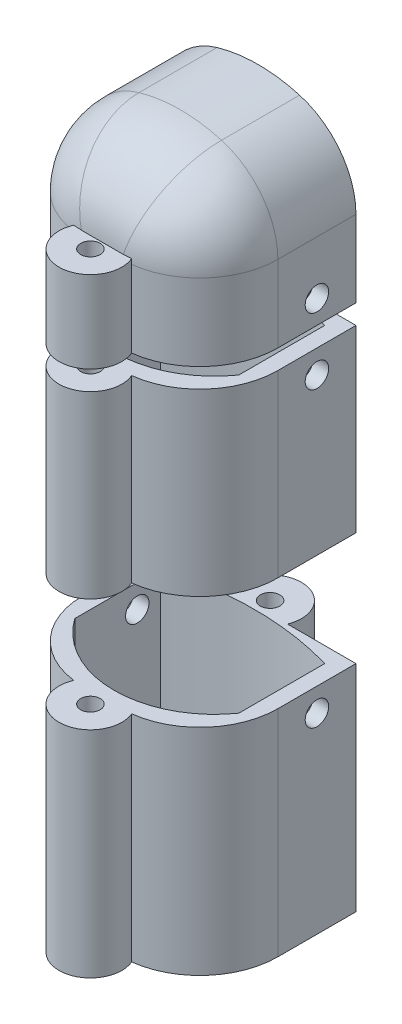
ISO-10303-21;
HEADER;
FILE_DESCRIPTION(('STEP AP214'),'2;1');
FILE_NAME('part.step','',(''),(''),'','','');
FILE_SCHEMA(('AUTOMOTIVE_DESIGN { 1 0 10303 214 1 1 1 1 }'));
ENDSEC;
DATA;
#1=APPLICATION_CONTEXT('core data for automotive mechanical design processes');
#2=APPLICATION_PROTOCOL_DEFINITION('international standard','automotive_design',2000,#1);
#3=PRODUCT_CONTEXT('',#1,'mechanical');
#4=PRODUCT('Part','Part','',(#3));
#5=PRODUCT_RELATED_PRODUCT_CATEGORY('part','',(#4));
#6=PRODUCT_DEFINITION_FORMATION('','',#4);
#7=PRODUCT_DEFINITION_CONTEXT('part definition',#1,'design');
#8=PRODUCT_DEFINITION('design','',#6,#7);
#9=PRODUCT_DEFINITION_SHAPE('','',#8);
#10=(LENGTH_UNIT() NAMED_UNIT(*) SI_UNIT(.MILLI.,.METRE.));
#11=(NAMED_UNIT(*) PLANE_ANGLE_UNIT() SI_UNIT($,.RADIAN.));
#12=(NAMED_UNIT(*) SI_UNIT($,.STERADIAN.) SOLID_ANGLE_UNIT());
#13=UNCERTAINTY_MEASURE_WITH_UNIT(LENGTH_MEASURE(1.E-05),#10,'distance_accuracy_value','');
#14=(GEOMETRIC_REPRESENTATION_CONTEXT(3) GLOBAL_UNCERTAINTY_ASSIGNED_CONTEXT((#13)) GLOBAL_UNIT_ASSIGNED_CONTEXT((#10,
#11,#12)) REPRESENTATION_CONTEXT('',''));
#15=CARTESIAN_POINT('',(0.,0.,0.));
#16=DIRECTION('',(0.,0.,1.));
#17=DIRECTION('',(1.,0.,0.));
#18=AXIS2_PLACEMENT_3D('',#15,#16,#17);
#19=CARTESIAN_POINT('',(-6.16812227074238,42.5,-1.5));
#20=DIRECTION('',(0.,-1.,0.));
#21=DIRECTION('',(0.,0.,-1.));
#22=AXIS2_PLACEMENT_3D('',#19,#20,#21);
#23=CYLINDRICAL_SURFACE('',#22,4.02504207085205);
#24=CARTESIAN_POINT('',(-6.16812227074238,32.023539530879,-1.5));
#25=DIRECTION('',(0.,1.,0.));
#26=DIRECTION('',(0.,0.,1.));
#27=AXIS2_PLACEMENT_3D('',#24,#25,#26);
#28=CIRCLE('',#27,4.02504207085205);
#29=CARTESIAN_POINT('',(-9.90322115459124,32.023539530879,0.));
#30=VERTEX_POINT('',#29);
#31=CARTESIAN_POINT('',(-2.43302338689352,32.023539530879,0.));
#32=VERTEX_POINT('',#31);
#33=EDGE_CURVE('E12',#30,#32,#28,.F.);
#34=ORIENTED_EDGE('',*,*,#33,.F.);
#35=DIRECTION('',(0.,-1.,0.));
#36=VECTOR('',#35,1.);
#37=CARTESIAN_POINT('',(-9.90322115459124,42.5,0.));
#38=LINE('',#37,#36);
#39=CARTESIAN_POINT('',(-9.90322115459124,42.5,0.));
#40=VERTEX_POINT('',#39);
#41=EDGE_CURVE('E511',#40,#30,#38,.T.);
#42=ORIENTED_EDGE('',*,*,#41,.F.);
#43=CARTESIAN_POINT('',(-6.16812227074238,42.5,-1.5));
#44=DIRECTION('',(0.,-1.,0.));
#45=DIRECTION('',(0.,0.,1.));
#46=AXIS2_PLACEMENT_3D('',#43,#44,#45);
#47=CIRCLE('',#46,4.02504207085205);
#48=CARTESIAN_POINT('',(-2.43302338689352,42.5,0.));
#49=VERTEX_POINT('',#48);
#50=EDGE_CURVE('E508',#40,#49,#47,.T.);
#51=ORIENTED_EDGE('',*,*,#50,.T.);
#52=DIRECTION('',(0.,-1.,0.));
#53=VECTOR('',#52,1.);
#54=CARTESIAN_POINT('',(-2.43302338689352,42.5,0.));
#55=LINE('',#54,#53);
#56=EDGE_CURVE('E322',#32,#49,#55,.F.);
#57=ORIENTED_EDGE('',*,*,#56,.F.);
#58=EDGE_LOOP('',(#34,#42,#51,#57));
#59=FACE_BOUND('',#58,.T.);
#60=ADVANCED_FACE('F54',(#59),#23,.T.);
#61=CARTESIAN_POINT('',(-6.16812227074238,42.5,-1.5));
#62=DIRECTION('',(0.,1.,0.));
#63=DIRECTION('',(0.,0.,1.));
#64=AXIS2_PLACEMENT_3D('',#61,#62,#63);
#65=PLANE('',#64);
#66=DIRECTION('',(-1.,0.,0.));
#67=VECTOR('',#66,1.);
#68=CARTESIAN_POINT('',(-3.66812227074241,42.5,0.));
#69=LINE('',#68,#67);
#70=EDGE_CURVE('E509',#49,#40,#69,.T.);
#71=ORIENTED_EDGE('',*,*,#70,.F.);
#72=ORIENTED_EDGE('',*,*,#50,.F.);
#73=EDGE_LOOP('',(#71,#72));
#74=FACE_BOUND('',#73,.T.);
#75=CARTESIAN_POINT('',(-6.16812227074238,42.5,-1.5));
#76=DIRECTION('',(0.,1.,0.));
#77=DIRECTION('',(0.,0.,1.));
#78=AXIS2_PLACEMENT_3D('',#75,#76,#77);
#79=CIRCLE('',#78,1.25);
#80=CARTESIAN_POINT('',(-6.16812227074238,42.5,-0.250000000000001));
#81=VERTEX_POINT('',#80);
#82=EDGE_CURVE('E361',#81,#81,#79,.T.);
#83=ORIENTED_EDGE('',*,*,#82,.F.);
#84=EDGE_LOOP('',(#83));
#85=FACE_BOUND('',#84,.T.);
#86=ADVANCED_FACE('F431',(#74,#85),#65,.T.);
#87=CARTESIAN_POINT('',(6.33187772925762,32.023539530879,23.));
#88=DIRECTION('',(0.,1.,0.));
#89=DIRECTION('',(0.,0.,1.));
#90=AXIS2_PLACEMENT_3D('',#87,#88,#89);
#91=PLANE('',#90);
#92=DIRECTION('',(-1.,0.,0.));
#93=VECTOR('',#92,1.);
#94=CARTESIAN_POINT('',(-18.6681222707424,32.023539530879,0.));
#95=LINE('',#94,#93);
#96=CARTESIAN_POINT('',(-18.6681222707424,32.023539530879,0.));
#97=VERTEX_POINT('',#96);
#98=EDGE_CURVE('E304',#30,#97,#95,.T.);
#99=ORIENTED_EDGE('',*,*,#98,.F.);
#100=ORIENTED_EDGE('',*,*,#33,.T.);
#101=CARTESIAN_POINT('',(6.33187772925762,32.023539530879,0.));
#102=VERTEX_POINT('',#101);
#103=EDGE_CURVE('E295',#102,#32,#95,.T.);
#104=ORIENTED_EDGE('',*,*,#103,.F.);
#105=DIRECTION('',(0.,0.,1.));
#106=VECTOR('',#105,1.);
#107=CARTESIAN_POINT('',(6.33187772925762,32.023539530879,0.));
#108=LINE('',#107,#106);
#109=CARTESIAN_POINT('',(6.33187772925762,32.023539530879,10.));
#110=VERTEX_POINT('',#109);
#111=EDGE_CURVE('E264',#102,#110,#108,.T.);
#112=ORIENTED_EDGE('',*,*,#111,.T.);
#113=CARTESIAN_POINT('',(-3.66812227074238,32.023539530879,10.));
#114=DIRECTION('',(0.,1.,0.));
#115=DIRECTION('',(0.,0.,1.));
#116=AXIS2_PLACEMENT_3D('',#113,#114,#115);
#117=CIRCLE('',#116,10.);
#118=CARTESIAN_POINT('',(-2.46311855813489,32.023539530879,19.9271328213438));
#119=VERTEX_POINT('',#118);
#120=EDGE_CURVE('E312',#110,#119,#117,.F.);
#121=ORIENTED_EDGE('',*,*,#120,.T.);
#122=CARTESIAN_POINT('',(-6.16812227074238,32.023539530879,21.5));
#123=DIRECTION('',(0.,1.,0.));
#124=DIRECTION('',(0.,0.,1.));
#125=AXIS2_PLACEMENT_3D('',#122,#123,#124);
#126=CIRCLE('',#125,4.02504207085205);
#127=CARTESIAN_POINT('',(-9.87312598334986,32.023539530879,19.9271328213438));
#128=VERTEX_POINT('',#127);
#129=EDGE_CURVE('E64',#119,#128,#126,.F.);
#130=ORIENTED_EDGE('',*,*,#129,.T.);
#131=CARTESIAN_POINT('',(-8.66812227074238,32.023539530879,10.));
#132=DIRECTION('',(0.,1.,0.));
#133=DIRECTION('',(0.,0.,1.));
#134=AXIS2_PLACEMENT_3D('',#131,#132,#133);
#135=CIRCLE('',#134,10.);
#136=CARTESIAN_POINT('',(-18.6681222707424,32.023539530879,10.));
#137=VERTEX_POINT('',#136);
#138=EDGE_CURVE('E262',#128,#137,#135,.F.);
#139=ORIENTED_EDGE('',*,*,#138,.T.);
#140=DIRECTION('',(0.,0.,1.));
#141=VECTOR('',#140,1.);
#142=CARTESIAN_POINT('',(-18.6681222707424,32.023539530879,0.));
#143=LINE('',#142,#141);
#144=EDGE_CURVE('E316',#97,#137,#143,.T.);
#145=ORIENTED_EDGE('',*,*,#144,.F.);
#146=EDGE_LOOP('',(#99,#100,#104,#112,#121,#130,#139,#145));
#147=FACE_BOUND('',#146,.T.);
#148=CARTESIAN_POINT('',(-6.16812227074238,32.023539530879,-1.5));
#149=DIRECTION('',(0.,1.,0.));
#150=DIRECTION('',(0.,0.,1.));
#151=AXIS2_PLACEMENT_3D('',#148,#149,#150);
#152=CIRCLE('',#151,1.25);
#153=CARTESIAN_POINT('',(-6.16812227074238,32.023539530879,-0.250000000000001));
#154=VERTEX_POINT('',#153);
#155=EDGE_CURVE('E265',#154,#154,#152,.T.);
#156=ORIENTED_EDGE('',*,*,#155,.T.);
#157=EDGE_LOOP('',(#156));
#158=FACE_BOUND('',#157,.T.);
#159=DIRECTION('',(0.,0.,1.));
#160=VECTOR('',#159,1.);
#161=CARTESIAN_POINT('',(-16.6681222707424,32.023539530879,0.));
#162=LINE('',#161,#160);
#163=CARTESIAN_POINT('',(-16.6681222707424,32.023539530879,2.));
#164=VERTEX_POINT('',#163);
#165=CARTESIAN_POINT('',(-16.6681222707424,32.023539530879,13.));
#166=VERTEX_POINT('',#165);
#167=EDGE_CURVE('E314',#164,#166,#162,.T.);
#168=ORIENTED_EDGE('',*,*,#167,.T.);
#169=DIRECTION('',(-1.,0.,0.));
#170=VECTOR('',#169,1.);
#171=CARTESIAN_POINT('',(-6.16812227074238,32.023539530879,13.));
#172=LINE('',#171,#170);
#173=CARTESIAN_POINT('',(4.33187772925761,32.023539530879,13.));
#174=VERTEX_POINT('',#173);
#175=EDGE_CURVE('E84',#174,#166,#172,.T.);
#176=ORIENTED_EDGE('',*,*,#175,.F.);
#177=DIRECTION('',(0.,0.,-1.));
#178=VECTOR('',#177,1.);
#179=CARTESIAN_POINT('',(4.33187772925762,32.023539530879,0.));
#180=LINE('',#179,#178);
#181=CARTESIAN_POINT('',(4.33187772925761,32.023539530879,2.));
#182=VERTEX_POINT('',#181);
#183=EDGE_CURVE('E331',#174,#182,#180,.T.);
#184=ORIENTED_EDGE('',*,*,#183,.T.);
#185=CARTESIAN_POINT('',(-6.16812227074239,32.023539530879,37.7609391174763));
#186=DIRECTION('',(0.,1.,0.));
#187=DIRECTION('',(0.,0.,1.));
#188=AXIS2_PLACEMENT_3D('',#185,#186,#187);
#189=CIRCLE('',#188,37.2705616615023);
#190=EDGE_CURVE('E334',#182,#164,#189,.T.);
#191=ORIENTED_EDGE('',*,*,#190,.T.);
#192=EDGE_LOOP('',(#168,#176,#184,#191));
#193=FACE_BOUND('',#192,.T.);
#194=CARTESIAN_POINT('',(-6.16812227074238,32.023539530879,21.5));
#195=DIRECTION('',(0.,1.,0.));
#196=DIRECTION('',(0.,0.,1.));
#197=AXIS2_PLACEMENT_3D('',#194,#195,#196);
#198=CIRCLE('',#197,1.25);
#199=CARTESIAN_POINT('',(-6.16812227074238,32.023539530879,22.75));
#200=VERTEX_POINT('',#199);
#201=EDGE_CURVE('E291',#200,#200,#198,.F.);
#202=ORIENTED_EDGE('',*,*,#201,.F.);
#203=EDGE_LOOP('',(#202));
#204=FACE_BOUND('',#203,.T.);
#205=ADVANCED_FACE('F384',(#147,#158,#193,#204),#91,.F.);
#206=CARTESIAN_POINT('',(-6.16812227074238,-47.4999999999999,-1.5));
#207=DIRECTION('',(0.,1.,0.));
#208=DIRECTION('',(0.,0.,1.));
#209=AXIS2_PLACEMENT_3D('',#206,#207,#208);
#210=CYLINDRICAL_SURFACE('',#209,1.25);
#211=CARTESIAN_POINT('',(-6.16812227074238,42.5,-0.250000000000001));
#212=CARTESIAN_POINT('',(-6.16812227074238,42.3908702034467,-0.250000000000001));
#213=CARTESIAN_POINT('',(-6.16812227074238,42.2817404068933,-0.250000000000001));
#214=CARTESIAN_POINT('',(-6.16812227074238,42.0634808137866,-0.250000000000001));
#215=CARTESIAN_POINT('',(-6.16812227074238,41.9543510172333,-0.250000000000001));
#216=CARTESIAN_POINT('',(-6.16812227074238,41.7360914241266,-0.250000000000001));
#217=CARTESIAN_POINT('',(-6.16812227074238,41.6269616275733,-0.250000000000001));
#218=CARTESIAN_POINT('',(-6.16812227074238,41.4087020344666,-0.250000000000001));
#219=CARTESIAN_POINT('',(-6.16812227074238,41.2995722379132,-0.250000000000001));
#220=CARTESIAN_POINT('',(-6.16812227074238,41.0813126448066,-0.250000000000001));
#221=CARTESIAN_POINT('',(-6.16812227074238,40.9721828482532,-0.250000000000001));
#222=CARTESIAN_POINT('',(-6.16812227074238,40.7539232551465,-0.250000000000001));
#223=CARTESIAN_POINT('',(-6.16812227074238,40.6447934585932,-0.250000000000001));
#224=CARTESIAN_POINT('',(-6.16812227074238,40.4265338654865,-0.250000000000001));
#225=CARTESIAN_POINT('',(-6.16812227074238,40.3174040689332,-0.250000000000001));
#226=CARTESIAN_POINT('',(-6.16812227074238,40.0991444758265,-0.250000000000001));
#227=CARTESIAN_POINT('',(-6.16812227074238,39.9900146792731,-0.250000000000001));
#228=CARTESIAN_POINT('',(-6.16812227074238,39.7717550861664,-0.250000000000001));
#229=CARTESIAN_POINT('',(-6.16812227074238,39.6626252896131,-0.250000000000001));
#230=CARTESIAN_POINT('',(-6.16812227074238,39.4443656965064,-0.250000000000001));
#231=CARTESIAN_POINT('',(-6.16812227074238,39.3352358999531,-0.250000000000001));
#232=CARTESIAN_POINT('',(-6.16812227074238,39.1169763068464,-0.250000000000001));
#233=CARTESIAN_POINT('',(-6.16812227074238,39.007846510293,-0.250000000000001));
#234=CARTESIAN_POINT('',(-6.16812227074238,38.7895869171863,-0.250000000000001));
#235=CARTESIAN_POINT('',(-6.16812227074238,38.680457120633,-0.250000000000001));
#236=CARTESIAN_POINT('',(-6.16812227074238,38.4621975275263,-0.250000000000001));
#237=CARTESIAN_POINT('',(-6.16812227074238,38.353067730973,-0.250000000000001));
#238=CARTESIAN_POINT('',(-6.16812227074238,38.1348081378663,-0.250000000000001));
#239=CARTESIAN_POINT('',(-6.16812227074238,38.0256783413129,-0.250000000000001));
#240=CARTESIAN_POINT('',(-6.16812227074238,37.8074187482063,-0.250000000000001));
#241=CARTESIAN_POINT('',(-6.16812227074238,37.6982889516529,-0.250000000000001));
#242=CARTESIAN_POINT('',(-6.16812227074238,37.4800293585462,-0.250000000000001));
#243=CARTESIAN_POINT('',(-6.16812227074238,37.3708995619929,-0.250000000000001));
#244=CARTESIAN_POINT('',(-6.16812227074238,37.1526399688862,-0.250000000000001));
#245=CARTESIAN_POINT('',(-6.16812227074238,37.0435101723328,-0.250000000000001));
#246=CARTESIAN_POINT('',(-6.16812227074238,36.8252505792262,-0.250000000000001));
#247=CARTESIAN_POINT('',(-6.16812227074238,36.7161207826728,-0.250000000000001));
#248=CARTESIAN_POINT('',(-6.16812227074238,36.4978611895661,-0.250000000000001));
#249=CARTESIAN_POINT('',(-6.16812227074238,36.3887313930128,-0.250000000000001));
#250=CARTESIAN_POINT('',(-6.16812227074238,36.1704717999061,-0.250000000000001));
#251=CARTESIAN_POINT('',(-6.16812227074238,36.0613420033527,-0.250000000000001));
#252=CARTESIAN_POINT('',(-6.16812227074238,35.8430824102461,-0.250000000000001));
#253=CARTESIAN_POINT('',(-6.16812227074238,35.7339526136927,-0.250000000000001));
#254=CARTESIAN_POINT('',(-6.16812227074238,35.515693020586,-0.250000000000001));
#255=CARTESIAN_POINT('',(-6.16812227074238,35.4065632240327,-0.250000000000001));
#256=CARTESIAN_POINT('',(-6.16812227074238,35.188303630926,-0.250000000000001));
#257=CARTESIAN_POINT('',(-6.16812227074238,35.0791738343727,-0.250000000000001));
#258=CARTESIAN_POINT('',(-6.16812227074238,34.860914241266,-0.250000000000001));
#259=CARTESIAN_POINT('',(-6.16812227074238,34.7517844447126,-0.250000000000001));
#260=CARTESIAN_POINT('',(-6.16812227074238,34.5335248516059,-0.250000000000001));
#261=CARTESIAN_POINT('',(-6.16812227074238,34.4243950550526,-0.250000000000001));
#262=CARTESIAN_POINT('',(-6.16812227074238,34.2061354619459,-0.250000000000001));
#263=CARTESIAN_POINT('',(-6.16812227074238,34.0970056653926,-0.250000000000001));
#264=CARTESIAN_POINT('',(-6.16812227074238,33.8787460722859,-0.250000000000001));
#265=CARTESIAN_POINT('',(-6.16812227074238,33.7696162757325,-0.250000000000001));
#266=CARTESIAN_POINT('',(-6.16812227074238,33.5513566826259,-0.250000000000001));
#267=CARTESIAN_POINT('',(-6.16812227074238,33.4422268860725,-0.250000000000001));
#268=CARTESIAN_POINT('',(-6.16812227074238,33.2239672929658,-0.250000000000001));
#269=CARTESIAN_POINT('',(-6.16812227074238,33.1148374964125,-0.250000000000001));
#270=CARTESIAN_POINT('',(-6.16812227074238,32.8965779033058,-0.250000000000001));
#271=CARTESIAN_POINT('',(-6.16812227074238,32.7874481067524,-0.250000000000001));
#272=CARTESIAN_POINT('',(-6.16812227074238,32.5691885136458,-0.250000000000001));
#273=CARTESIAN_POINT('',(-6.16812227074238,32.4600587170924,-0.250000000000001));
#274=CARTESIAN_POINT('',(-6.16812227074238,32.2417991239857,-0.250000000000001));
#275=CARTESIAN_POINT('',(-6.16812227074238,32.1326693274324,-0.250000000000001));
#276=CARTESIAN_POINT('',(-6.16812227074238,32.023539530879,-0.250000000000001));
#277=B_SPLINE_CURVE_WITH_KNOTS('',3,(#211,#212,#213,#214,#215,#216,#217,#218,#219,#220,#221,
#222,#223,#224,#225,#226,#227,#228,#229,#230,#231,#232,#233,#234,#235,#236,#237,#238,#239,#240,
#241,#242,#243,#244,#245,#246,#247,#248,#249,#250,#251,#252,#253,#254,#255,#256,#257,#258,#259,
#260,#261,#262,#263,#264,#265,#266,#267,#268,#269,#270,#271,#272,#273,#274,#275,#276),
.UNSPECIFIED.,.F.,.F.,(4,2,2,2,2,2,2,2,2,2,2,2,2,2,2,2,2,2,2,2,2,2,2,2,2,2,2,2,2,2,2,2,4),(0.,
0.327389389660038,0.654778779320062,0.982168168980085,1.30955755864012,1.63694694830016,
1.96433633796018,2.29172572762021,2.61911511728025,2.94650450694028,3.27389389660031,
3.60128328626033,3.92867267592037,4.25606206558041,4.58345145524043,4.91084084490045,
5.23823023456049,5.56561962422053,5.89300901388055,6.22039840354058,6.54778779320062,
6.87517718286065,7.20256657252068,7.5299559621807,7.85734535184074,8.18473474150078,
8.5121241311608,8.83951352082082,9.16690291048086,9.4942923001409,9.82168168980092,
10.1490710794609,10.476460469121),.UNSPECIFIED.);
#278=EDGE_CURVE('BSEAM538',#81,#154,#277,.T.);
#279=ORIENTED_EDGE('',*,*,#82,.T.);
#280=ORIENTED_EDGE('',*,*,#155,.F.);
#281=ORIENTED_EDGE('',*,*,#278,.T.);
#282=ORIENTED_EDGE('',*,*,#278,.F.);
#283=EDGE_LOOP('',(#279,#281,#280,#282));
#284=FACE_BOUND('',#283,.T.);
#285=ADVANCED_FACE('F538',(#284),#210,.F.);
#286=CARTESIAN_POINT('',(-6.16812227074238,39.4758302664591,2.));
#287=DIRECTION('',(0.,0.,1.));
#288=DIRECTION('',(1.,0.,0.));
#289=AXIS2_PLACEMENT_3D('',#286,#287,#288);
#290=PLANE('',#289);
#291=DIRECTION('',(0.,-1.,0.));
#292=VECTOR('',#291,1.);
#293=CARTESIAN_POINT('',(-16.6681222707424,43.4999999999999,2.));
#294=LINE('',#293,#292);
#295=CARTESIAN_POINT('',(-16.6681222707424,40.702632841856,2.));
#296=VERTEX_POINT('',#295);
#297=CARTESIAN_POINT('',(-16.6681222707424,37.5,2.));
#298=VERTEX_POINT('',#297);
#299=EDGE_CURVE('E368',#296,#298,#294,.T.);
#300=ORIENTED_EDGE('',*,*,#299,.F.);
#301=CARTESIAN_POINT('',(-6.16812227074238,39.101316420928,2.));
#302=DIRECTION('',(0.,0.,1.));
#303=DIRECTION('',(1.,0.,0.));
#304=AXIS2_PLACEMENT_3D('',#301,#302,#303);
#305=CIRCLE('',#304,10.621403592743);
#306=EDGE_CURVE('E258',#298,#296,#305,.F.);
#307=ORIENTED_EDGE('',*,*,#306,.F.);
#308=EDGE_LOOP('',(#300,#307));
#309=FACE_BOUND('',#308,.T.);
#310=ADVANCED_FACE('F461',(#309),#290,.T.);
#311=CARTESIAN_POINT('',(-15.8358933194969,43.4999999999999,2.));
#312=VERTEX_POINT('',#311);
#313=CARTESIAN_POINT('',(3.49964877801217,43.4999999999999,2.));
#314=VERTEX_POINT('',#313);
#315=EDGE_CURVE('E577',#312,#314,#305,.F.);
#316=ORIENTED_EDGE('',*,*,#315,.F.);
#317=DIRECTION('',(1.,0.,0.));
#318=VECTOR('',#317,1.);
#319=CARTESIAN_POINT('',(-6.16812227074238,43.4999999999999,2.));
#320=LINE('',#319,#318);
#321=EDGE_CURVE('E346',#312,#314,#320,.T.);
#322=ORIENTED_EDGE('',*,*,#321,.T.);
#323=EDGE_LOOP('',(#316,#322));
#324=FACE_BOUND('',#323,.T.);
#325=ADVANCED_FACE('F462',(#324),#290,.T.);
#326=CARTESIAN_POINT('',(-6.16812227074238,42.5,21.5));
#327=DIRECTION('',(0.,-1.,0.));
#328=DIRECTION('',(0.,0.,-1.));
#329=AXIS2_PLACEMENT_3D('',#326,#327,#328);
#330=CYLINDRICAL_SURFACE('',#329,1.25);
#331=ORIENTED_EDGE('',*,*,#201,.T.);
#332=EDGE_LOOP('',(#331));
#333=FACE_BOUND('',#332,.T.);
#334=CARTESIAN_POINT('',(-6.16812227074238,42.5,21.5));
#335=DIRECTION('',(0.,-1.,0.));
#336=DIRECTION('',(0.,0.,-1.));
#337=AXIS2_PLACEMENT_3D('',#334,#335,#336);
#338=CIRCLE('',#337,1.25);
#339=CARTESIAN_POINT('',(-6.16812227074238,42.5,20.25));
#340=VERTEX_POINT('',#339);
#341=EDGE_CURVE('E340',#340,#340,#338,.T.);
#342=ORIENTED_EDGE('',*,*,#341,.F.);
#343=EDGE_LOOP('',(#342));
#344=FACE_BOUND('',#343,.T.);
#345=ADVANCED_FACE('F469',(#333,#344),#330,.F.);
#346=CARTESIAN_POINT('',(-3.66812227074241,42.5,20.));
#347=DIRECTION('',(0.,0.,-1.));
#348=DIRECTION('',(-1.,0.,0.));
#349=AXIS2_PLACEMENT_3D('',#346,#347,#348);
#350=PLANE('',#349);
#351=CARTESIAN_POINT('',(-6.16812227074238,33.2194921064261,20.));
#352=DIRECTION('',(0.,0.,-1.));
#353=DIRECTION('',(-1.,0.,0.));
#354=AXIS2_PLACEMENT_3D('',#351,#352,#353);
#355=CIRCLE('',#354,8.97848533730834);
#356=CARTESIAN_POINT('',(-3.66812227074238,41.8429020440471,20.));
#357=VERTEX_POINT('',#356);
#358=CARTESIAN_POINT('',(-8.66812227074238,41.8429020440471,20.));
#359=VERTEX_POINT('',#358);
#360=EDGE_CURVE('E288',#357,#359,#355,.F.);
#361=ORIENTED_EDGE('',*,*,#360,.T.);
#362=DIRECTION('',(0.,-1.,0.));
#363=VECTOR('',#362,1.);
#364=CARTESIAN_POINT('',(-8.66812227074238,42.5,20.));
#365=LINE('',#364,#363);
#366=CARTESIAN_POINT('',(-8.66812227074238,42.5,20.));
#367=VERTEX_POINT('',#366);
#368=EDGE_CURVE('E341',#367,#359,#365,.T.);
#369=ORIENTED_EDGE('',*,*,#368,.F.);
#370=DIRECTION('',(1.,0.,0.));
#371=VECTOR('',#370,1.);
#372=CARTESIAN_POINT('',(-3.66812227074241,42.5,20.));
#373=LINE('',#372,#371);
#374=CARTESIAN_POINT('',(-3.66812227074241,42.5,20.));
#375=VERTEX_POINT('',#374);
#376=EDGE_CURVE('E226',#367,#375,#373,.T.);
#377=ORIENTED_EDGE('',*,*,#376,.T.);
#378=DIRECTION('',(0.,-1.,0.));
#379=VECTOR('',#378,1.);
#380=CARTESIAN_POINT('',(-3.66812227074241,42.5,20.));
#381=LINE('',#380,#379);
#382=EDGE_CURVE('E337',#375,#357,#381,.T.);
#383=ORIENTED_EDGE('',*,*,#382,.T.);
#384=EDGE_LOOP('',(#361,#369,#377,#383));
#385=FACE_BOUND('',#384,.T.);
#386=ADVANCED_FACE('F420',(#385),#350,.T.);
#387=CARTESIAN_POINT('',(-6.16812227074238,42.5,21.5));
#388=DIRECTION('',(0.,-1.,0.));
#389=DIRECTION('',(0.,0.,-1.));
#390=AXIS2_PLACEMENT_3D('',#387,#388,#389);
#391=PLANE('',#390);
#392=ORIENTED_EDGE('',*,*,#376,.F.);
#393=DIRECTION('',(0.99817665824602,0.,0.0603602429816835));
#394=VECTOR('',#393,1.);
#395=CARTESIAN_POINT('',(-8.66812227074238,42.5,20.));
#396=LINE('',#395,#394);
#397=CARTESIAN_POINT('',(-9.87312598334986,42.5,19.9271328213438));
#398=VERTEX_POINT('',#397);
#399=EDGE_CURVE('E212',#398,#367,#396,.T.);
#400=ORIENTED_EDGE('',*,*,#399,.F.);
#401=CARTESIAN_POINT('',(-6.16812227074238,42.5,21.5));
#402=DIRECTION('',(0.,-1.,0.));
#403=DIRECTION('',(0.,0.,-1.));
#404=AXIS2_PLACEMENT_3D('',#401,#402,#403);
#405=CIRCLE('',#404,4.02504207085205);
#406=CARTESIAN_POINT('',(-2.4631185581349,42.5,19.9271328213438));
#407=VERTEX_POINT('',#406);
#408=EDGE_CURVE('E216',#407,#398,#405,.T.);
#409=ORIENTED_EDGE('',*,*,#408,.F.);
#410=DIRECTION('',(0.99817665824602,0.,-0.0603602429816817));
#411=VECTOR('',#410,1.);
#412=CARTESIAN_POINT('',(-3.66812227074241,42.5,20.));
#413=LINE('',#412,#411);
#414=EDGE_CURVE('E239',#375,#407,#413,.T.);
#415=ORIENTED_EDGE('',*,*,#414,.F.);
#416=EDGE_LOOP('',(#392,#400,#409,#415));
#417=FACE_BOUND('',#416,.T.);
#418=ORIENTED_EDGE('',*,*,#341,.T.);
#419=EDGE_LOOP('',(#418));
#420=FACE_BOUND('',#419,.T.);
#421=ADVANCED_FACE('F224',(#417,#420),#391,.F.);
#422=CARTESIAN_POINT('',(-18.6681222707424,-47.5,20.));
#423=DIRECTION('',(1.,0.,0.));
#424=DIRECTION('',(0.,0.,-1.));
#425=AXIS2_PLACEMENT_3D('',#422,#423,#424);
#426=PLANE('',#425);
#427=CARTESIAN_POINT('',(-18.6681222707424,35.023539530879,5.00000000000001));
#428=DIRECTION('',(1.,0.,0.));
#429=DIRECTION('',(0.,0.,-1.));
#430=AXIS2_PLACEMENT_3D('',#427,#428,#429);
#431=CIRCLE('',#430,1.5);
#432=CARTESIAN_POINT('',(-18.6681222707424,35.023539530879,3.50000000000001));
#433=VERTEX_POINT('',#432);
#434=EDGE_CURVE('E310',#433,#433,#431,.T.);
#435=ORIENTED_EDGE('',*,*,#434,.T.);
#436=EDGE_LOOP('',(#435));
#437=FACE_BOUND('',#436,.T.);
#438=DIRECTION('',(0.,0.,-1.));
#439=VECTOR('',#438,1.);
#440=CARTESIAN_POINT('',(-18.6681222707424,41.8429020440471,20.));
#441=LINE('',#440,#439);
#442=CARTESIAN_POINT('',(-18.6681222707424,41.8429020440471,10.));
#443=VERTEX_POINT('',#442);
#444=CARTESIAN_POINT('',(-18.6681222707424,41.8429020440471,0.));
#445=VERTEX_POINT('',#444);
#446=EDGE_CURVE('E307',#443,#445,#441,.T.);
#447=ORIENTED_EDGE('',*,*,#446,.T.);
#448=DIRECTION('',(0.,-1.,0.));
#449=VECTOR('',#448,1.);
#450=CARTESIAN_POINT('',(-18.6681222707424,-47.5,0.));
#451=LINE('',#450,#449);
#452=EDGE_CURVE('E309',#445,#97,#451,.T.);
#453=ORIENTED_EDGE('',*,*,#452,.T.);
#454=ORIENTED_EDGE('',*,*,#144,.T.);
#455=DIRECTION('',(0.,-1.,0.));
#456=VECTOR('',#455,1.);
#457=CARTESIAN_POINT('',(-18.6681222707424,-47.5,10.));
#458=LINE('',#457,#456);
#459=EDGE_CURVE('E319',#137,#443,#458,.F.);
#460=ORIENTED_EDGE('',*,*,#459,.T.);
#461=EDGE_LOOP('',(#447,#453,#454,#460));
#462=FACE_BOUND('',#461,.T.);
#463=ADVANCED_FACE('F472',(#437,#462),#426,.F.);
#464=CARTESIAN_POINT('',(6.33187772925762,-47.5,20.));
#465=DIRECTION('',(-1.,0.,0.));
#466=DIRECTION('',(0.,0.,1.));
#467=AXIS2_PLACEMENT_3D('',#464,#465,#466);
#468=PLANE('',#467);
#469=CARTESIAN_POINT('',(6.33187772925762,35.023539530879,5.00000000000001));
#470=DIRECTION('',(1.,0.,0.));
#471=DIRECTION('',(0.,0.,-1.));
#472=AXIS2_PLACEMENT_3D('',#469,#470,#471);
#473=CIRCLE('',#472,1.5);
#474=CARTESIAN_POINT('',(6.33187772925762,35.023539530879,3.50000000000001));
#475=VERTEX_POINT('',#474);
#476=EDGE_CURVE('E352',#475,#475,#473,.T.);
#477=ORIENTED_EDGE('',*,*,#476,.F.);
#478=EDGE_LOOP('',(#477));
#479=FACE_BOUND('',#478,.T.);
#480=DIRECTION('',(0.,1.,0.));
#481=VECTOR('',#480,1.);
#482=CARTESIAN_POINT('',(6.33187772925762,-47.5,10.));
#483=LINE('',#482,#481);
#484=CARTESIAN_POINT('',(6.33187772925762,41.8429020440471,10.));
#485=VERTEX_POINT('',#484);
#486=EDGE_CURVE('E327',#485,#110,#483,.F.);
#487=ORIENTED_EDGE('',*,*,#486,.T.);
#488=ORIENTED_EDGE('',*,*,#111,.F.);
#489=DIRECTION('',(0.,1.,0.));
#490=VECTOR('',#489,1.);
#491=CARTESIAN_POINT('',(6.33187772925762,-47.5,0.));
#492=LINE('',#491,#490);
#493=CARTESIAN_POINT('',(6.33187772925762,41.8429020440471,0.));
#494=VERTEX_POINT('',#493);
#495=EDGE_CURVE('E296',#102,#494,#492,.T.);
#496=ORIENTED_EDGE('',*,*,#495,.T.);
#497=DIRECTION('',(0.,0.,-1.));
#498=VECTOR('',#497,1.);
#499=CARTESIAN_POINT('',(6.33187772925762,41.8429020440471,20.));
#500=LINE('',#499,#498);
#501=EDGE_CURVE('E292',#494,#485,#500,.F.);
#502=ORIENTED_EDGE('',*,*,#501,.T.);
#503=EDGE_LOOP('',(#487,#488,#496,#502));
#504=FACE_BOUND('',#503,.T.);
#505=ADVANCED_FACE('F389',(#479,#504),#468,.F.);
#506=CARTESIAN_POINT('',(-6.16812227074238,33.2194921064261,0.));
#507=DIRECTION('',(0.,0.,-1.));
#508=DIRECTION('',(-1.,0.,0.));
#509=AXIS2_PLACEMENT_3D('',#506,#507,#508);
#510=PLANE('',#509);
#511=ORIENTED_EDGE('',*,*,#103,.T.);
#512=ORIENTED_EDGE('',*,*,#56,.T.);
#513=ORIENTED_EDGE('',*,*,#70,.T.);
#514=ORIENTED_EDGE('',*,*,#41,.T.);
#515=ORIENTED_EDGE('',*,*,#98,.T.);
#516=ORIENTED_EDGE('',*,*,#452,.F.);
#517=CARTESIAN_POINT('',(-8.66812227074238,41.8429020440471,0.));
#518=DIRECTION('',(0.,0.,-1.));
#519=DIRECTION('',(-1.,0.,0.));
#520=AXIS2_PLACEMENT_3D('',#517,#518,#519);
#521=CIRCLE('',#520,10.);
#522=CARTESIAN_POINT('',(-11.4525562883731,51.4474284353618,0.));
#523=VERTEX_POINT('',#522);
#524=EDGE_CURVE('E300',#445,#523,#521,.T.);
#525=ORIENTED_EDGE('',*,*,#524,.T.);
#526=CARTESIAN_POINT('',(-6.16812227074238,33.2194921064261,0.));
#527=DIRECTION('',(0.,0.,1.));
#528=DIRECTION('',(-1.,0.,0.));
#529=AXIS2_PLACEMENT_3D('',#526,#527,#528);
#530=CIRCLE('',#529,18.9784853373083);
#531=CARTESIAN_POINT('',(-0.883688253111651,51.4474284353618,0.));
#532=VERTEX_POINT('',#531);
#533=EDGE_CURVE('E276',#532,#523,#530,.T.);
#534=ORIENTED_EDGE('',*,*,#533,.F.);
#535=CARTESIAN_POINT('',(-3.66812227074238,41.8429020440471,0.));
#536=DIRECTION('',(0.,0.,-1.));
#537=DIRECTION('',(-1.,0.,0.));
#538=AXIS2_PLACEMENT_3D('',#535,#536,#537);
#539=CIRCLE('',#538,10.);
#540=EDGE_CURVE('E303',#532,#494,#539,.T.);
#541=ORIENTED_EDGE('',*,*,#540,.T.);
#542=ORIENTED_EDGE('',*,*,#495,.F.);
#543=EDGE_LOOP('',(#511,#512,#513,#514,#515,#516,#525,#534,#541,#542));
#544=FACE_BOUND('',#543,.T.);
#545=ADVANCED_FACE('F391',(#544),#510,.T.);
#546=CARTESIAN_POINT('',(-3.66812227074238,33.2194921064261,10.));
#547=DIRECTION('',(0.,1.,0.));
#548=DIRECTION('',(0.,0.,1.));
#549=AXIS2_PLACEMENT_3D('',#546,#547,#548);
#550=CYLINDRICAL_SURFACE('',#549,10.);
#551=DIRECTION('',(0.,-1.,0.));
#552=VECTOR('',#551,1.);
#553=CARTESIAN_POINT('',(-2.4631185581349,42.5,19.9271328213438));
#554=LINE('',#553,#552);
#555=CARTESIAN_POINT('',(-2.46311855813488,41.8429020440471,19.9271328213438));
#556=VERTEX_POINT('',#555);
#557=EDGE_CURVE('E277',#556,#119,#554,.T.);
#558=ORIENTED_EDGE('',*,*,#557,.T.);
#559=ORIENTED_EDGE('',*,*,#120,.F.);
#560=ORIENTED_EDGE('',*,*,#486,.F.);
#561=CARTESIAN_POINT('',(-3.66812227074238,41.8429020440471,10.));
#562=DIRECTION('',(0.,1.,0.));
#563=DIRECTION('',(0.,0.,1.));
#564=AXIS2_PLACEMENT_3D('',#561,#562,#563);
#565=CIRCLE('',#564,10.);
#566=EDGE_CURVE('E266',#556,#485,#565,.T.);
#567=ORIENTED_EDGE('',*,*,#566,.F.);
#568=EDGE_LOOP('',(#558,#559,#560,#567));
#569=FACE_BOUND('',#568,.T.);
#570=ADVANCED_FACE('F381',(#569),#550,.T.);
#571=CARTESIAN_POINT('',(-8.66812227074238,33.2194921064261,10.));
#572=DIRECTION('',(0.,-1.,0.));
#573=DIRECTION('',(0.,0.,-1.));
#574=AXIS2_PLACEMENT_3D('',#571,#572,#573);
#575=CYLINDRICAL_SURFACE('',#574,10.);
#576=DIRECTION('',(0.,-1.,0.));
#577=VECTOR('',#576,1.);
#578=CARTESIAN_POINT('',(-9.87312598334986,42.5,19.9271328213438));
#579=LINE('',#578,#577);
#580=CARTESIAN_POINT('',(-9.87312598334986,41.8429020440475,19.9271328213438));
#581=VERTEX_POINT('',#580);
#582=EDGE_CURVE('E215',#581,#128,#579,.T.);
#583=ORIENTED_EDGE('',*,*,#582,.F.);
#584=CARTESIAN_POINT('',(-8.66812227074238,41.8429020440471,10.));
#585=DIRECTION('',(0.,-1.,0.));
#586=DIRECTION('',(0.,0.,-1.));
#587=AXIS2_PLACEMENT_3D('',#584,#585,#586);
#588=CIRCLE('',#587,10.);
#589=EDGE_CURVE('E274',#581,#443,#588,.T.);
#590=ORIENTED_EDGE('',*,*,#589,.T.);
#591=ORIENTED_EDGE('',*,*,#459,.F.);
#592=ORIENTED_EDGE('',*,*,#138,.F.);
#593=EDGE_LOOP('',(#583,#590,#591,#592));
#594=FACE_BOUND('',#593,.T.);
#595=ADVANCED_FACE('F483',(#594),#575,.T.);
#596=CARTESIAN_POINT('',(-6.16812227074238,33.2194921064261,20.));
#597=DIRECTION('',(0.,0.,-1.));
#598=DIRECTION('',(-1.,0.,0.));
#599=AXIS2_PLACEMENT_3D('',#596,#597,#598);
#600=CYLINDRICAL_SURFACE('',#599,18.9784853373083);
#601=ORIENTED_EDGE('',*,*,#533,.T.);
#602=DIRECTION('',(0.,0.,-1.));
#603=VECTOR('',#602,1.);
#604=CARTESIAN_POINT('',(-11.4525562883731,51.4474284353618,20.));
#605=LINE('',#604,#603);
#606=CARTESIAN_POINT('',(-11.4525562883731,51.4474284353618,10.));
#607=VERTEX_POINT('',#606);
#608=EDGE_CURVE('E285',#523,#607,#605,.F.);
#609=ORIENTED_EDGE('',*,*,#608,.T.);
#610=CARTESIAN_POINT('',(-6.16812227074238,33.2194921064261,10.));
#611=DIRECTION('',(0.,0.,-1.));
#612=DIRECTION('',(-1.,0.,0.));
#613=AXIS2_PLACEMENT_3D('',#610,#611,#612);
#614=CIRCLE('',#613,18.9784853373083);
#615=CARTESIAN_POINT('',(-0.883688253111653,51.4474284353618,10.));
#616=VERTEX_POINT('',#615);
#617=EDGE_CURVE('E281',#607,#616,#614,.T.);
#618=ORIENTED_EDGE('',*,*,#617,.T.);
#619=DIRECTION('',(0.,0.,-1.));
#620=VECTOR('',#619,1.);
#621=CARTESIAN_POINT('',(-0.883688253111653,51.4474284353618,20.));
#622=LINE('',#621,#620);
#623=EDGE_CURVE('E284',#616,#532,#622,.T.);
#624=ORIENTED_EDGE('',*,*,#623,.T.);
#625=EDGE_LOOP('',(#601,#609,#618,#624));
#626=FACE_BOUND('',#625,.T.);
#627=ADVANCED_FACE('F408',(#626),#600,.T.);
#628=CARTESIAN_POINT('',(-8.66812227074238,41.8429020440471,20.));
#629=DIRECTION('',(0.,0.,-1.));
#630=DIRECTION('',(-1.,0.,0.));
#631=AXIS2_PLACEMENT_3D('',#628,#629,#630);
#632=CYLINDRICAL_SURFACE('',#631,10.);
#633=ORIENTED_EDGE('',*,*,#446,.F.);
#634=CARTESIAN_POINT('',(-8.66812227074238,41.8429020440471,10.));
#635=DIRECTION('',(0.,0.,-1.));
#636=DIRECTION('',(-1.,0.,0.));
#637=AXIS2_PLACEMENT_3D('',#634,#635,#636);
#638=CIRCLE('',#637,10.);
#639=EDGE_CURVE('E280',#443,#607,#638,.T.);
#640=ORIENTED_EDGE('',*,*,#639,.T.);
#641=ORIENTED_EDGE('',*,*,#608,.F.);
#642=ORIENTED_EDGE('',*,*,#524,.F.);
#643=EDGE_LOOP('',(#633,#640,#641,#642));
#644=FACE_BOUND('',#643,.T.);
#645=ADVANCED_FACE('F413',(#644),#632,.T.);
#646=CARTESIAN_POINT('',(-3.66812227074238,41.8429020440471,20.));
#647=DIRECTION('',(0.,0.,-1.));
#648=DIRECTION('',(-1.,0.,0.));
#649=AXIS2_PLACEMENT_3D('',#646,#647,#648);
#650=CYLINDRICAL_SURFACE('',#649,10.);
#651=ORIENTED_EDGE('',*,*,#623,.F.);
#652=CARTESIAN_POINT('',(-3.66812227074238,41.8429020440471,10.));
#653=DIRECTION('',(0.,0.,-1.));
#654=DIRECTION('',(-1.,0.,0.));
#655=AXIS2_PLACEMENT_3D('',#652,#653,#654);
#656=CIRCLE('',#655,10.);
#657=EDGE_CURVE('E269',#616,#485,#656,.T.);
#658=ORIENTED_EDGE('',*,*,#657,.T.);
#659=ORIENTED_EDGE('',*,*,#501,.F.);
#660=ORIENTED_EDGE('',*,*,#540,.F.);
#661=EDGE_LOOP('',(#651,#658,#659,#660));
#662=FACE_BOUND('',#661,.T.);
#663=ADVANCED_FACE('F398',(#662),#650,.T.);
#664=CARTESIAN_POINT('',(-3.66812227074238,41.8429020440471,10.));
#665=DIRECTION('',(0.,0.,-1.));
#666=DIRECTION('',(-1.,0.,0.));
#667=AXIS2_PLACEMENT_3D('',#664,#665,#666);
#668=SPHERICAL_SURFACE('',#667,10.);
#669=CARTESIAN_POINT('',(-3.06562041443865,41.8429020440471,19.9635664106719));
#670=DIRECTION('',(-0.0603602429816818,0.,-0.99817665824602));
#671=DIRECTION('',(-0.99817665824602,0.,0.0603602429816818));
#672=AXIS2_PLACEMENT_3D('',#669,#670,#671);
#673=CIRCLE('',#672,0.603602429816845);
#674=CARTESIAN_POINT('',(-3.57438240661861,42.1662449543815,19.9943315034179));
#675=VERTEX_POINT('',#674);
#676=EDGE_CURVE('E373',#556,#675,#673,.F.);
#677=ORIENTED_EDGE('',*,*,#676,.F.);
#678=ORIENTED_EDGE('',*,*,#566,.T.);
#679=ORIENTED_EDGE('',*,*,#657,.F.);
#680=CARTESIAN_POINT('',(-3.66812227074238,41.8429020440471,10.));
#681=DIRECTION('',(-0.960452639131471,0.278443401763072,0.));
#682=DIRECTION('',(-0.278443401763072,-0.960452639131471,0.));
#683=AXIS2_PLACEMENT_3D('',#680,#681,#682);
#684=CIRCLE('',#683,10.);
#685=EDGE_CURVE('E268',#675,#616,#684,.T.);
#686=ORIENTED_EDGE('',*,*,#685,.F.);
#687=EDGE_LOOP('',(#677,#678,#679,#686));
#688=FACE_BOUND('',#687,.T.);
#689=ADVANCED_FACE('F402',(#688),#668,.T.);
#690=CARTESIAN_POINT('',(-6.16812227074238,33.2194921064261,10.));
#691=DIRECTION('',(0.,0.,-1.));
#692=DIRECTION('',(-1.,0.,0.));
#693=AXIS2_PLACEMENT_3D('',#690,#691,#692);
#694=DEGENERATE_TOROIDAL_SURFACE('',#693,8.97848533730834,10.,.T.);
#695=CARTESIAN_POINT('',(-8.66812230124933,41.8427020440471,19.9999999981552));
#696=CARTESIAN_POINT('',(-8.66799563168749,41.8763996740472,20.0000076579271));
#697=CARTESIAN_POINT('',(-8.67068992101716,41.910138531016,19.9998447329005));
#698=CARTESIAN_POINT('',(-8.68166567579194,41.9764827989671,19.9991810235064));
#699=CARTESIAN_POINT('',(-8.68991418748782,42.0090937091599,19.9986822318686));
#700=CARTESIAN_POINT('',(-8.71196949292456,42.0724629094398,19.9973485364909));
#701=CARTESIAN_POINT('',(-8.725789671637,42.1032165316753,19.9965128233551));
#702=CARTESIAN_POINT('',(-8.75818845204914,42.1620722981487,19.9945536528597));
#703=CARTESIAN_POINT('',(-8.77677023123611,42.1901726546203,19.9934300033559));
#704=CARTESIAN_POINT('',(-8.82599993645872,42.2542228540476,19.9904530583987));
#705=CARTESIAN_POINT('',(-8.8584876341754,42.2887468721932,19.9884885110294));
#706=CARTESIAN_POINT('',(-8.9284574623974,42.3523629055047,19.9842574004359));
#707=CARTESIAN_POINT('',(-8.96596119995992,42.3814300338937,19.9819895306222));
#708=CARTESIAN_POINT('',(-9.05580533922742,42.4425410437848,19.9765566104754));
#709=CARTESIAN_POINT('',(-9.10927338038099,42.4729620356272,19.9733233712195));
#710=CARTESIAN_POINT('',(-9.16389937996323,42.5002,19.9700201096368));
#711=B_SPLINE_CURVE_WITH_KNOTS('',3,(#695,#696,#697,#698,#699,#700,#701,#702,#703,#704,#705,
#706,#707,#708,#709,#710),.UNSPECIFIED.,.F.,.F.,(4,2,2,2,2,2,2,4),(0.,0.101030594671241,
0.201466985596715,0.302146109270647,0.402892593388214,0.544412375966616,0.686562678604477,
0.870359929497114),.UNSPECIFIED.);
#712=CARTESIAN_POINT('',(-8.76186213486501,42.1662449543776,19.994331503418));
#713=VERTEX_POINT('',#712);
#714=EDGE_CURVE('E228',#359,#713,#711,.T.);
#715=ORIENTED_EDGE('',*,*,#714,.F.);
#716=ORIENTED_EDGE('',*,*,#360,.F.);
#717=CARTESIAN_POINT('',(-3.17234516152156,42.5002,19.9700201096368));
#718=CARTESIAN_POINT('',(-3.21275608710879,42.4801067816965,19.9724637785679));
#719=CARTESIAN_POINT('',(-3.25245049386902,42.4582589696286,19.9748641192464));
#720=CARTESIAN_POINT('',(-3.32991014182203,42.409959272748,19.9795481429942));
#721=CARTESIAN_POINT('',(-3.36762799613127,42.3834318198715,19.9818289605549));
#722=CARTESIAN_POINT('',(-3.43931444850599,42.3251760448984,19.9861638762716));
#723=CARTESIAN_POINT('',(-3.47325935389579,42.2934176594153,19.9882165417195));
#724=CARTESIAN_POINT('',(-3.53478947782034,42.2244843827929,19.9919372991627));
#725=CARTESIAN_POINT('',(-3.56242087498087,42.1873522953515,19.9936081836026));
#726=CARTESIAN_POINT('',(-3.60264632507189,42.1188167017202,19.9960406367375));
#727=CARTESIAN_POINT('',(-3.61728621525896,42.0886210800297,19.9969259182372));
#728=CARTESIAN_POINT('',(-3.64119496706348,42.0261133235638,19.9983716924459));
#729=CARTESIAN_POINT('',(-3.65046110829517,41.993800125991,19.998932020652));
#730=CARTESIAN_POINT('',(-3.66070537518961,41.9414815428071,19.9995514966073));
#731=CARTESIAN_POINT('',(-3.66352155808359,41.9218150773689,19.9997217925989));
#732=CARTESIAN_POINT('',(-3.66723517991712,41.8823323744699,19.999946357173));
#733=CARTESIAN_POINT('',(-3.66813578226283,41.8625164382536,20.0000008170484));
#734=CARTESIAN_POINT('',(-3.66812224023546,41.8427020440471,19.9999999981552));
#735=B_SPLINE_CURVE_WITH_KNOTS('',3,(#717,#718,#719,#720,#721,#722,#723,#724,#725,#726,#727,
#728,#729,#730,#731,#732,#733,#734),.UNSPECIFIED.,.F.,.F.,(4,2,2,2,2,2,2,2,4),(0.,
0.135761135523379,0.273957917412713,0.412978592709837,0.550947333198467,0.651209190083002,
0.751521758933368,0.811039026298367,0.870457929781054),.UNSPECIFIED.);
#736=EDGE_CURVE('E240',#675,#357,#735,.T.);
#737=ORIENTED_EDGE('',*,*,#736,.F.);
#738=ORIENTED_EDGE('',*,*,#685,.T.);
#739=ORIENTED_EDGE('',*,*,#617,.F.);
#740=CARTESIAN_POINT('',(-8.66812227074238,41.8429020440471,10.));
#741=DIRECTION('',(-0.960452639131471,-0.278443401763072,0.));
#742=DIRECTION('',(0.278443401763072,-0.960452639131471,0.));
#743=AXIS2_PLACEMENT_3D('',#740,#741,#742);
#744=CIRCLE('',#743,10.);
#745=EDGE_CURVE('E271',#713,#607,#744,.T.);
#746=ORIENTED_EDGE('',*,*,#745,.F.);
#747=EDGE_LOOP('',(#715,#716,#737,#738,#739,#746));
#748=FACE_BOUND('',#747,.T.);
#749=ADVANCED_FACE('F405',(#748),#694,.T.);
#750=CARTESIAN_POINT('',(-8.66812227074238,41.8429020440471,10.));
#751=DIRECTION('',(0.,0.,-1.));
#752=DIRECTION('',(-1.,0.,0.));
#753=AXIS2_PLACEMENT_3D('',#750,#751,#752);
#754=SPHERICAL_SURFACE('',#753,10.);
#755=CARTESIAN_POINT('',(-9.27062412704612,41.8429020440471,19.9635664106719));
#756=DIRECTION('',(0.0603602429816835,0.,-0.99817665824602));
#757=DIRECTION('',(-0.99817665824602,0.,-0.0603602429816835));
#758=AXIS2_PLACEMENT_3D('',#755,#756,#757);
#759=CIRCLE('',#758,0.603602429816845);
#760=EDGE_CURVE('E214',#713,#581,#759,.F.);
#761=ORIENTED_EDGE('',*,*,#760,.F.);
#762=ORIENTED_EDGE('',*,*,#745,.T.);
#763=ORIENTED_EDGE('',*,*,#639,.F.);
#764=ORIENTED_EDGE('',*,*,#589,.F.);
#765=EDGE_LOOP('',(#761,#762,#763,#764));
#766=FACE_BOUND('',#765,.T.);
#767=ADVANCED_FACE('F417',(#766),#754,.T.);
#768=CARTESIAN_POINT('',(-16.6681222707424,37.5,13.));
#769=DIRECTION('',(-1.,0.,0.));
#770=DIRECTION('',(0.,-1.,0.));
#771=AXIS2_PLACEMENT_3D('',#768,#769,#770);
#772=PLANE('',#771);
#773=CARTESIAN_POINT('',(-16.6681222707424,35.023539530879,5.00000000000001));
#774=DIRECTION('',(-1.,0.,0.));
#775=DIRECTION('',(0.,-1.,0.));
#776=AXIS2_PLACEMENT_3D('',#773,#774,#775);
#777=CIRCLE('',#776,1.5);
#778=CARTESIAN_POINT('',(-16.6681222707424,33.523539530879,5.00000000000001));
#779=VERTEX_POINT('',#778);
#780=EDGE_CURVE('E273',#779,#779,#777,.T.);
#781=ORIENTED_EDGE('',*,*,#780,.T.);
#782=EDGE_LOOP('',(#781));
#783=FACE_BOUND('',#782,.T.);
#784=ORIENTED_EDGE('',*,*,#167,.F.);
#785=DIRECTION('',(0.,1.,0.));
#786=VECTOR('',#785,1.);
#787=CARTESIAN_POINT('',(-16.6681222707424,37.5,2.));
#788=LINE('',#787,#786);
#789=EDGE_CURVE('E351',#164,#298,#788,.T.);
#790=ORIENTED_EDGE('',*,*,#789,.T.);
#791=DIRECTION('',(0.,0.,-1.));
#792=VECTOR('',#791,1.);
#793=CARTESIAN_POINT('',(-16.6681222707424,37.5,13.));
#794=LINE('',#793,#792);
#795=CARTESIAN_POINT('',(-16.6681222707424,37.5000000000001,13.));
#796=VERTEX_POINT('',#795);
#797=EDGE_CURVE('E255',#796,#298,#794,.T.);
#798=ORIENTED_EDGE('',*,*,#797,.F.);
#799=DIRECTION('',(0.,1.,0.));
#800=VECTOR('',#799,1.);
#801=CARTESIAN_POINT('',(-16.6681222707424,37.5,13.));
#802=LINE('',#801,#800);
#803=EDGE_CURVE('E242',#166,#796,#802,.T.);
#804=ORIENTED_EDGE('',*,*,#803,.F.);
#805=EDGE_LOOP('',(#784,#790,#798,#804));
#806=FACE_BOUND('',#805,.T.);
#807=ADVANCED_FACE('F494',(#783,#806),#772,.F.);
#808=CARTESIAN_POINT('',(4.33187772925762,37.5,13.));
#809=DIRECTION('',(1.,0.,0.));
#810=DIRECTION('',(0.,1.,0.));
#811=AXIS2_PLACEMENT_3D('',#808,#809,#810);
#812=PLANE('',#811);
#813=CARTESIAN_POINT('',(4.33187772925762,35.023539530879,5.00000000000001));
#814=DIRECTION('',(1.,0.,0.));
#815=DIRECTION('',(0.,1.,0.));
#816=AXIS2_PLACEMENT_3D('',#813,#814,#815);
#817=CIRCLE('',#816,1.5);
#818=CARTESIAN_POINT('',(4.33187772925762,36.523539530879,5.00000000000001));
#819=VERTEX_POINT('',#818);
#820=EDGE_CURVE('E261',#819,#819,#817,.T.);
#821=ORIENTED_EDGE('',*,*,#820,.T.);
#822=EDGE_LOOP('',(#821));
#823=FACE_BOUND('',#822,.T.);
#824=DIRECTION('',(0.,0.,-1.));
#825=VECTOR('',#824,1.);
#826=CARTESIAN_POINT('',(4.33187772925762,37.5,13.));
#827=LINE('',#826,#825);
#828=CARTESIAN_POINT('',(4.33187772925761,37.5,13.));
#829=VERTEX_POINT('',#828);
#830=CARTESIAN_POINT('',(4.33187772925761,37.4999999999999,2.));
#831=VERTEX_POINT('',#830);
#832=EDGE_CURVE('E250',#829,#831,#827,.T.);
#833=ORIENTED_EDGE('',*,*,#832,.T.);
#834=DIRECTION('',(0.,-1.,0.));
#835=VECTOR('',#834,1.);
#836=CARTESIAN_POINT('',(4.33187772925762,37.5,2.));
#837=LINE('',#836,#835);
#838=EDGE_CURVE('E246',#831,#182,#837,.T.);
#839=ORIENTED_EDGE('',*,*,#838,.T.);
#840=ORIENTED_EDGE('',*,*,#183,.F.);
#841=DIRECTION('',(0.,-1.,0.));
#842=VECTOR('',#841,1.);
#843=CARTESIAN_POINT('',(4.33187772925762,37.5,13.));
#844=LINE('',#843,#842);
#845=EDGE_CURVE('E243',#829,#174,#844,.T.);
#846=ORIENTED_EDGE('',*,*,#845,.F.);
#847=EDGE_LOOP('',(#833,#839,#840,#846));
#848=FACE_BOUND('',#847,.T.);
#849=ADVANCED_FACE('F543',(#823,#848),#812,.F.);
#850=CARTESIAN_POINT('',(-6.16812227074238,39.101316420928,13.));
#851=DIRECTION('',(0.,0.,1.));
#852=DIRECTION('',(1.,0.,0.));
#853=AXIS2_PLACEMENT_3D('',#850,#851,#852);
#854=PLANE('',#853);
#855=ORIENTED_EDGE('',*,*,#845,.T.);
#856=ORIENTED_EDGE('',*,*,#175,.T.);
#857=ORIENTED_EDGE('',*,*,#803,.T.);
#858=CARTESIAN_POINT('',(-6.16812227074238,39.101316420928,13.));
#859=DIRECTION('',(0.,0.,-1.));
#860=DIRECTION('',(1.,0.,0.));
#861=AXIS2_PLACEMENT_3D('',#858,#859,#860);
#862=CIRCLE('',#861,10.621403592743);
#863=EDGE_CURVE('E244',#796,#829,#862,.T.);
#864=ORIENTED_EDGE('',*,*,#863,.T.);
#865=EDGE_LOOP('',(#855,#856,#857,#864));
#866=FACE_BOUND('',#865,.T.);
#867=ADVANCED_FACE('F539',(#866),#854,.F.);
#868=CARTESIAN_POINT('',(-6.16812227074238,39.101316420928,13.));
#869=DIRECTION('',(0.,0.,-1.));
#870=DIRECTION('',(-1.,0.,0.));
#871=AXIS2_PLACEMENT_3D('',#868,#869,#870);
#872=CYLINDRICAL_SURFACE('',#871,10.621403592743);
#873=ORIENTED_EDGE('',*,*,#797,.T.);
#874=ORIENTED_EDGE('',*,*,#306,.T.);
#875=EDGE_CURVE('E524',#296,#312,#305,.F.);
#876=ORIENTED_EDGE('',*,*,#875,.T.);
#877=ORIENTED_EDGE('',*,*,#315,.T.);
#878=CARTESIAN_POINT('',(4.33187772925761,40.7026328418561,2.));
#879=VERTEX_POINT('',#878);
#880=EDGE_CURVE('E576',#314,#879,#305,.F.);
#881=ORIENTED_EDGE('',*,*,#880,.T.);
#882=EDGE_CURVE('E356',#879,#831,#305,.F.);
#883=ORIENTED_EDGE('',*,*,#882,.T.);
#884=ORIENTED_EDGE('',*,*,#832,.F.);
#885=ORIENTED_EDGE('',*,*,#863,.F.);
#886=EDGE_LOOP('',(#873,#874,#876,#877,#881,#883,#884,#885));
#887=FACE_BOUND('',#886,.T.);
#888=ADVANCED_FACE('F542',(#887),#872,.F.);
#889=CARTESIAN_POINT('',(-26.6681222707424,35.023539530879,5.00000000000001));
#890=DIRECTION('',(1.,0.,0.));
#891=DIRECTION('',(0.,0.,-1.));
#892=AXIS2_PLACEMENT_3D('',#889,#890,#891);
#893=CYLINDRICAL_SURFACE('',#892,1.5);
#894=ORIENTED_EDGE('',*,*,#476,.T.);
#895=EDGE_LOOP('',(#894));
#896=FACE_BOUND('',#895,.T.);
#897=ORIENTED_EDGE('',*,*,#820,.F.);
#898=EDGE_LOOP('',(#897));
#899=FACE_BOUND('',#898,.T.);
#900=ADVANCED_FACE('F465',(#896,#899),#893,.F.);
#901=ORIENTED_EDGE('',*,*,#780,.F.);
#902=EDGE_LOOP('',(#901));
#903=FACE_BOUND('',#902,.T.);
#904=ORIENTED_EDGE('',*,*,#434,.F.);
#905=EDGE_LOOP('',(#904));
#906=FACE_BOUND('',#905,.T.);
#907=ADVANCED_FACE('F459',(#903,#906),#893,.F.);
#908=DIRECTION('',(0.,-1.,0.));
#909=VECTOR('',#908,1.);
#910=CARTESIAN_POINT('',(4.33187772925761,43.4999999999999,2.));
#911=LINE('',#910,#909);
#912=EDGE_CURVE('E364',#831,#879,#911,.F.);
#913=ORIENTED_EDGE('',*,*,#912,.F.);
#914=ORIENTED_EDGE('',*,*,#882,.F.);
#915=EDGE_LOOP('',(#913,#914));
#916=FACE_BOUND('',#915,.T.);
#917=ADVANCED_FACE('F454',(#916),#290,.T.);
#918=CARTESIAN_POINT('',(-16.6681222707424,43.4999999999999,2.));
#919=DIRECTION('',(0.,0.,1.));
#920=DIRECTION('',(1.,0.,0.));
#921=AXIS2_PLACEMENT_3D('',#918,#919,#920);
#922=PLANE('',#921);
#923=DIRECTION('',(0.,-1.,0.));
#924=VECTOR('',#923,1.);
#925=CARTESIAN_POINT('',(-16.6681222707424,43.4999999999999,2.));
#926=LINE('',#925,#924);
#927=CARTESIAN_POINT('',(-16.6681222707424,43.4999999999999,2.));
#928=VERTEX_POINT('',#927);
#929=EDGE_CURVE('E365',#928,#296,#926,.T.);
#930=ORIENTED_EDGE('',*,*,#929,.F.);
#931=DIRECTION('',(-1.,0.,0.));
#932=VECTOR('',#931,1.);
#933=CARTESIAN_POINT('',(-16.6681222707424,43.4999999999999,2.));
#934=LINE('',#933,#932);
#935=EDGE_CURVE('E343',#312,#928,#934,.T.);
#936=ORIENTED_EDGE('',*,*,#935,.F.);
#937=ORIENTED_EDGE('',*,*,#875,.F.);
#938=EDGE_LOOP('',(#930,#936,#937));
#939=FACE_BOUND('',#938,.T.);
#940=ADVANCED_FACE('F452',(#939),#922,.F.);
#941=CARTESIAN_POINT('',(4.33187772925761,43.4999999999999,2.));
#942=VERTEX_POINT('',#941);
#943=EDGE_CURVE('E369',#942,#314,#934,.T.);
#944=ORIENTED_EDGE('',*,*,#943,.F.);
#945=DIRECTION('',(0.,-1.,0.));
#946=VECTOR('',#945,1.);
#947=CARTESIAN_POINT('',(4.33187772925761,43.4999999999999,2.));
#948=LINE('',#947,#946);
#949=EDGE_CURVE('E355',#942,#879,#948,.T.);
#950=ORIENTED_EDGE('',*,*,#949,.T.);
#951=ORIENTED_EDGE('',*,*,#880,.F.);
#952=EDGE_LOOP('',(#944,#950,#951));
#953=FACE_BOUND('',#952,.T.);
#954=ADVANCED_FACE('F448',(#953),#922,.F.);
#955=CARTESIAN_POINT('',(-6.16812227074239,43.4999999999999,37.7609391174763));
#956=DIRECTION('',(0.,-1.,0.));
#957=DIRECTION('',(0.,0.,-1.));
#958=AXIS2_PLACEMENT_3D('',#955,#956,#957);
#959=CYLINDRICAL_SURFACE('',#958,37.2705616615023);
#960=ORIENTED_EDGE('',*,*,#838,.F.);
#961=ORIENTED_EDGE('',*,*,#912,.T.);
#962=ORIENTED_EDGE('',*,*,#949,.F.);
#963=CARTESIAN_POINT('',(-6.16812227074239,43.4999999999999,37.7609391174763));
#964=DIRECTION('',(0.,-1.,0.));
#965=DIRECTION('',(0.,0.,-1.));
#966=AXIS2_PLACEMENT_3D('',#963,#964,#965);
#967=CIRCLE('',#966,37.2705616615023);
#968=EDGE_CURVE('E371',#928,#942,#967,.T.);
#969=ORIENTED_EDGE('',*,*,#968,.F.);
#970=ORIENTED_EDGE('',*,*,#929,.T.);
#971=ORIENTED_EDGE('',*,*,#299,.T.);
#972=ORIENTED_EDGE('',*,*,#789,.F.);
#973=ORIENTED_EDGE('',*,*,#190,.F.);
#974=EDGE_LOOP('',(#960,#961,#962,#969,#970,#971,#972,#973));
#975=FACE_BOUND('',#974,.T.);
#976=ADVANCED_FACE('F443',(#975),#959,.F.);
#977=CARTESIAN_POINT('',(-6.16812227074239,43.4999999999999,37.7609391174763));
#978=DIRECTION('',(0.,-1.,0.));
#979=DIRECTION('',(0.,0.,-1.));
#980=AXIS2_PLACEMENT_3D('',#977,#978,#979);
#981=PLANE('',#980);
#982=ORIENTED_EDGE('',*,*,#968,.T.);
#983=ORIENTED_EDGE('',*,*,#943,.T.);
#984=ORIENTED_EDGE('',*,*,#321,.F.);
#985=ORIENTED_EDGE('',*,*,#935,.T.);
#986=EDGE_LOOP('',(#982,#983,#984,#985));
#987=FACE_BOUND('',#986,.T.);
#988=ADVANCED_FACE('F439',(#987),#981,.T.);
#989=CARTESIAN_POINT('',(-8.66812227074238,42.5,20.));
#990=DIRECTION('',(0.0603602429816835,0.,-0.99817665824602));
#991=DIRECTION('',(-0.99817665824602,0.,-0.0603602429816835));
#992=AXIS2_PLACEMENT_3D('',#989,#990,#991);
#993=PLANE('',#992);
#994=ORIENTED_EDGE('',*,*,#368,.T.);
#995=ORIENTED_EDGE('',*,*,#714,.T.);
#996=ORIENTED_EDGE('',*,*,#760,.T.);
#997=EDGE_CURVE('E207',#398,#581,#579,.T.);
#998=ORIENTED_EDGE('',*,*,#997,.F.);
#999=ORIENTED_EDGE('',*,*,#399,.T.);
#1000=EDGE_LOOP('',(#994,#995,#996,#998,#999));
#1001=FACE_BOUND('',#1000,.T.);
#1002=ADVANCED_FACE('F210',(#1001),#993,.T.);
#1003=CARTESIAN_POINT('',(-6.16812227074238,42.5,21.5));
#1004=DIRECTION('',(0.,-1.,0.));
#1005=DIRECTION('',(0.,0.,-1.));
#1006=AXIS2_PLACEMENT_3D('',#1003,#1004,#1005);
#1007=CYLINDRICAL_SURFACE('',#1006,4.02504207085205);
#1008=ORIENTED_EDGE('',*,*,#582,.T.);
#1009=ORIENTED_EDGE('',*,*,#129,.F.);
#1010=ORIENTED_EDGE('',*,*,#557,.F.);
#1011=EDGE_CURVE('E58',#407,#556,#554,.T.);
#1012=ORIENTED_EDGE('',*,*,#1011,.F.);
#1013=ORIENTED_EDGE('',*,*,#408,.T.);
#1014=ORIENTED_EDGE('',*,*,#997,.T.);
#1015=EDGE_LOOP('',(#1008,#1009,#1010,#1012,#1013,#1014));
#1016=FACE_BOUND('',#1015,.T.);
#1017=ADVANCED_FACE('F56',(#1016),#1007,.T.);
#1018=CARTESIAN_POINT('',(-3.66812227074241,42.5,20.));
#1019=DIRECTION('',(-0.0603602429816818,0.,-0.99817665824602));
#1020=DIRECTION('',(-0.99817665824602,0.,0.0603602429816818));
#1021=AXIS2_PLACEMENT_3D('',#1018,#1019,#1020);
#1022=PLANE('',#1021);
#1023=ORIENTED_EDGE('',*,*,#1011,.T.);
#1024=ORIENTED_EDGE('',*,*,#676,.T.);
#1025=ORIENTED_EDGE('',*,*,#736,.T.);
#1026=ORIENTED_EDGE('',*,*,#382,.F.);
#1027=ORIENTED_EDGE('',*,*,#414,.T.);
#1028=EDGE_LOOP('',(#1023,#1024,#1025,#1026,#1027));
#1029=FACE_BOUND('',#1028,.T.);
#1030=ADVANCED_FACE('F422',(#1029),#1022,.T.);
#1031=CLOSED_SHELL('',(#60,#86,#205,#285,#310,#325,#345,#386,#421,#463,#505,#545,#570,#595,#627,
#645,#663,#689,#749,#767,#807,#849,#867,#888,#900,#907,#917,#940,#954,#976,#988,#1002,#1017,#1030));
#1032=MANIFOLD_SOLID_BREP('B2',#1031);
#1033=CARTESIAN_POINT('',(-26.6681222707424,26.523539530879,5.00000000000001));
#1034=DIRECTION('',(1.,0.,0.));
#1035=DIRECTION('',(0.,0.,-1.));
#1036=AXIS2_PLACEMENT_3D('',#1033,#1034,#1035);
#1037=CYLINDRICAL_SURFACE('',#1036,1.5);
#1038=CARTESIAN_POINT('',(6.33187772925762,26.523539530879,5.00000000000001));
#1039=DIRECTION('',(1.,0.,0.));
#1040=DIRECTION('',(0.,0.,-1.));
#1041=AXIS2_PLACEMENT_3D('',#1038,#1039,#1040);
#1042=CIRCLE('',#1041,1.5);
#1043=CARTESIAN_POINT('',(6.33187772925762,26.523539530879,3.50000000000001));
#1044=VERTEX_POINT('',#1043);
#1045=EDGE_CURVE('E965',#1044,#1044,#1042,.T.);
#1046=ORIENTED_EDGE('',*,*,#1045,.T.);
#1047=EDGE_LOOP('',(#1046));
#1048=FACE_BOUND('',#1047,.T.);
#1049=CARTESIAN_POINT('',(4.33187772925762,26.523539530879,5.00000000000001));
#1050=DIRECTION('',(1.,0.,0.));
#1051=DIRECTION('',(0.,1.,0.));
#1052=AXIS2_PLACEMENT_3D('',#1049,#1050,#1051);
#1053=CIRCLE('',#1052,1.5);
#1054=CARTESIAN_POINT('',(4.33187772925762,28.023539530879,5.00000000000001));
#1055=VERTEX_POINT('',#1054);
#1056=EDGE_CURVE('E960',#1055,#1055,#1053,.T.);
#1057=ORIENTED_EDGE('',*,*,#1056,.F.);
#1058=EDGE_LOOP('',(#1057));
#1059=FACE_BOUND('',#1058,.T.);
#1060=ADVANCED_FACE('F836',(#1048,#1059),#1037,.F.);
#1061=CARTESIAN_POINT('',(-16.6681222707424,26.523539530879,5.00000000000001));
#1062=DIRECTION('',(-1.,0.,0.));
#1063=DIRECTION('',(0.,-1.,0.));
#1064=AXIS2_PLACEMENT_3D('',#1061,#1062,#1063);
#1065=CIRCLE('',#1064,1.5);
#1066=CARTESIAN_POINT('',(-16.6681222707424,25.023539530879,5.00000000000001));
#1067=VERTEX_POINT('',#1066);
#1068=EDGE_CURVE('E950',#1067,#1067,#1065,.T.);
#1069=ORIENTED_EDGE('',*,*,#1068,.F.);
#1070=EDGE_LOOP('',(#1069));
#1071=FACE_BOUND('',#1070,.T.);
#1072=CARTESIAN_POINT('',(-18.6681222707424,26.523539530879,5.00000000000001));
#1073=DIRECTION('',(1.,0.,0.));
#1074=DIRECTION('',(0.,0.,-1.));
#1075=AXIS2_PLACEMENT_3D('',#1072,#1073,#1074);
#1076=CIRCLE('',#1075,1.5);
#1077=CARTESIAN_POINT('',(-18.6681222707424,26.523539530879,3.50000000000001));
#1078=VERTEX_POINT('',#1077);
#1079=EDGE_CURVE('E956',#1078,#1078,#1076,.T.);
#1080=ORIENTED_EDGE('',*,*,#1079,.F.);
#1081=EDGE_LOOP('',(#1080));
#1082=FACE_BOUND('',#1081,.T.);
#1083=ADVANCED_FACE('F1077',(#1071,#1082),#1037,.F.);
#1084=CARTESIAN_POINT('',(-6.16812227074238,42.5,-1.5));
#1085=DIRECTION('',(0.,-1.,0.));
#1086=DIRECTION('',(0.,0.,-1.));
#1087=AXIS2_PLACEMENT_3D('',#1084,#1085,#1086);
#1088=CYLINDRICAL_SURFACE('',#1087,1.25);
#1089=CARTESIAN_POINT('',(-6.16812227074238,6.52353953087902,-1.5));
#1090=DIRECTION('',(0.,1.,0.));
#1091=DIRECTION('',(-1.,0.,0.));
#1092=AXIS2_PLACEMENT_3D('',#1089,#1090,#1091);
#1093=CIRCLE('',#1092,1.25);
#1094=CARTESIAN_POINT('',(-6.16812227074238,6.52353953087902,-2.75));
#1095=VERTEX_POINT('',#1094);
#1096=EDGE_CURVE('E968',#1095,#1095,#1093,.F.);
#1097=CARTESIAN_POINT('',(-6.16812227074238,29.523539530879,-1.5));
#1098=DIRECTION('',(0.,-1.,0.));
#1099=DIRECTION('',(0.,0.,-1.));
#1100=AXIS2_PLACEMENT_3D('',#1097,#1098,#1099);
#1101=CIRCLE('',#1100,1.25);
#1102=CARTESIAN_POINT('',(-6.16812227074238,29.523539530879,-2.75));
#1103=VERTEX_POINT('',#1102);
#1104=EDGE_CURVE('E978',#1103,#1103,#1101,.T.);
#1105=CARTESIAN_POINT('',(-6.16812227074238,6.52353953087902,-2.75));
#1106=CARTESIAN_POINT('',(-6.16812227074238,6.76312286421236,-2.75));
#1107=CARTESIAN_POINT('',(-6.16812227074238,7.00270619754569,-2.75));
#1108=CARTESIAN_POINT('',(-6.16812227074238,7.48187286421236,-2.75));
#1109=CARTESIAN_POINT('',(-6.16812227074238,7.72145619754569,-2.75));
#1110=CARTESIAN_POINT('',(-6.16812227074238,8.20062286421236,-2.75));
#1111=CARTESIAN_POINT('',(-6.16812227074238,8.44020619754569,-2.75));
#1112=CARTESIAN_POINT('',(-6.16812227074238,8.91937286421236,-2.75));
#1113=CARTESIAN_POINT('',(-6.16812227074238,9.15895619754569,-2.75));
#1114=CARTESIAN_POINT('',(-6.16812227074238,9.63812286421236,-2.75));
#1115=CARTESIAN_POINT('',(-6.16812227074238,9.87770619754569,-2.75));
#1116=CARTESIAN_POINT('',(-6.16812227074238,10.3568728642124,-2.75));
#1117=CARTESIAN_POINT('',(-6.16812227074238,10.5964561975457,-2.75));
#1118=CARTESIAN_POINT('',(-6.16812227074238,11.0756228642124,-2.75));
#1119=CARTESIAN_POINT('',(-6.16812227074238,11.3152061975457,-2.75));
#1120=CARTESIAN_POINT('',(-6.16812227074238,11.7943728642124,-2.75));
#1121=CARTESIAN_POINT('',(-6.16812227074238,12.0339561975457,-2.75));
#1122=CARTESIAN_POINT('',(-6.16812227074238,12.5131228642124,-2.75));
#1123=CARTESIAN_POINT('',(-6.16812227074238,12.7527061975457,-2.75));
#1124=CARTESIAN_POINT('',(-6.16812227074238,13.2318728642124,-2.75));
#1125=CARTESIAN_POINT('',(-6.16812227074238,13.4714561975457,-2.75));
#1126=CARTESIAN_POINT('',(-6.16812227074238,13.9506228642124,-2.75));
#1127=CARTESIAN_POINT('',(-6.16812227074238,14.1902061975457,-2.75));
#1128=CARTESIAN_POINT('',(-6.16812227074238,14.6693728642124,-2.75));
#1129=CARTESIAN_POINT('',(-6.16812227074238,14.9089561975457,-2.75));
#1130=CARTESIAN_POINT('',(-6.16812227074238,15.3881228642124,-2.75));
#1131=CARTESIAN_POINT('',(-6.16812227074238,15.6277061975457,-2.75));
#1132=CARTESIAN_POINT('',(-6.16812227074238,16.1068728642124,-2.75));
#1133=CARTESIAN_POINT('',(-6.16812227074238,16.3464561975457,-2.75));
#1134=CARTESIAN_POINT('',(-6.16812227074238,16.8256228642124,-2.75));
#1135=CARTESIAN_POINT('',(-6.16812227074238,17.0652061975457,-2.75));
#1136=CARTESIAN_POINT('',(-6.16812227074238,17.5443728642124,-2.75));
#1137=CARTESIAN_POINT('',(-6.16812227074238,17.7839561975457,-2.75));
#1138=CARTESIAN_POINT('',(-6.16812227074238,18.2631228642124,-2.75));
#1139=CARTESIAN_POINT('',(-6.16812227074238,18.5027061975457,-2.75));
#1140=CARTESIAN_POINT('',(-6.16812227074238,18.9818728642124,-2.75));
#1141=CARTESIAN_POINT('',(-6.16812227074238,19.2214561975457,-2.75));
#1142=CARTESIAN_POINT('',(-6.16812227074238,19.7006228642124,-2.75));
#1143=CARTESIAN_POINT('',(-6.16812227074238,19.9402061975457,-2.75));
#1144=CARTESIAN_POINT('',(-6.16812227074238,20.4193728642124,-2.75));
#1145=CARTESIAN_POINT('',(-6.16812227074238,20.6589561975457,-2.75));
#1146=CARTESIAN_POINT('',(-6.16812227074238,21.1381228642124,-2.75));
#1147=CARTESIAN_POINT('',(-6.16812227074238,21.3777061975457,-2.75));
#1148=CARTESIAN_POINT('',(-6.16812227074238,21.8568728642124,-2.75));
#1149=CARTESIAN_POINT('',(-6.16812227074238,22.0964561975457,-2.75));
#1150=CARTESIAN_POINT('',(-6.16812227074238,22.5756228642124,-2.75));
#1151=CARTESIAN_POINT('',(-6.16812227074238,22.8152061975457,-2.75));
#1152=CARTESIAN_POINT('',(-6.16812227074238,23.2943728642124,-2.75));
#1153=CARTESIAN_POINT('',(-6.16812227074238,23.5339561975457,-2.75));
#1154=CARTESIAN_POINT('',(-6.16812227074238,24.0131228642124,-2.75));
#1155=CARTESIAN_POINT('',(-6.16812227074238,24.2527061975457,-2.75));
#1156=CARTESIAN_POINT('',(-6.16812227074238,24.7318728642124,-2.75));
#1157=CARTESIAN_POINT('',(-6.16812227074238,24.9714561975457,-2.75));
#1158=CARTESIAN_POINT('',(-6.16812227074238,25.4506228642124,-2.75));
#1159=CARTESIAN_POINT('',(-6.16812227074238,25.6902061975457,-2.75));
#1160=CARTESIAN_POINT('',(-6.16812227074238,26.1693728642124,-2.75));
#1161=CARTESIAN_POINT('',(-6.16812227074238,26.4089561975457,-2.75));
#1162=CARTESIAN_POINT('',(-6.16812227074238,26.8881228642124,-2.75));
#1163=CARTESIAN_POINT('',(-6.16812227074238,27.1277061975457,-2.75));
#1164=CARTESIAN_POINT('',(-6.16812227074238,27.6068728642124,-2.75));
#1165=CARTESIAN_POINT('',(-6.16812227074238,27.8464561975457,-2.75));
#1166=CARTESIAN_POINT('',(-6.16812227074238,28.3256228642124,-2.75));
#1167=CARTESIAN_POINT('',(-6.16812227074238,28.5652061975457,-2.75));
#1168=CARTESIAN_POINT('',(-6.16812227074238,29.0443728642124,-2.75));
#1169=CARTESIAN_POINT('',(-6.16812227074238,29.2839561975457,-2.75));
#1170=CARTESIAN_POINT('',(-6.16812227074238,29.523539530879,-2.75));
#1171=B_SPLINE_CURVE_WITH_KNOTS('',3,(#1105,#1106,#1107,#1108,#1109,#1110,#1111,#1112,#1113,
#1114,#1115,#1116,#1117,#1118,#1119,#1120,#1121,#1122,#1123,#1124,#1125,#1126,#1127,#1128,#1129,
#1130,#1131,#1132,#1133,#1134,#1135,#1136,#1137,#1138,#1139,#1140,#1141,#1142,#1143,#1144,#1145,
#1146,#1147,#1148,#1149,#1150,#1151,#1152,#1153,#1154,#1155,#1156,#1157,#1158,#1159,#1160,#1161,
#1162,#1163,#1164,#1165,#1166,#1167,#1168,#1169,#1170),.UNSPECIFIED.,.F.,.F.,(4,2,2,2,2,2,2,2,2,
2,2,2,2,2,2,2,2,2,2,2,2,2,2,2,2,2,2,2,2,2,2,2,4),(0.,0.718749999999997,1.4375,2.15625,2.875,
3.59375,4.3125,5.03125,5.75,6.46875,7.1875,7.90625,8.625,9.34375,10.0625,10.78125,11.5,12.21875,
12.9375,13.65625,14.375,15.09375,15.8125,16.53125,17.25,17.96875,18.6875,19.40625,20.125,
20.84375,21.5625,22.28125,23.),.UNSPECIFIED.);
#1172=EDGE_CURVE('BSEAM1075',#1095,#1103,#1171,.T.);
#1173=ORIENTED_EDGE('',*,*,#1096,.T.);
#1174=ORIENTED_EDGE('',*,*,#1104,.F.);
#1175=ORIENTED_EDGE('',*,*,#1172,.T.);
#1176=ORIENTED_EDGE('',*,*,#1172,.F.);
#1177=EDGE_LOOP('',(#1173,#1175,#1174,#1176));
#1178=FACE_BOUND('',#1177,.T.);
#1179=ADVANCED_FACE('F1075',(#1178),#1088,.F.);
#1180=CARTESIAN_POINT('',(-6.16812227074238,42.5,21.5));
#1181=DIRECTION('',(0.,-1.,0.));
#1182=DIRECTION('',(0.,0.,-1.));
#1183=AXIS2_PLACEMENT_3D('',#1180,#1181,#1182);
#1184=CYLINDRICAL_SURFACE('',#1183,1.25);
#1185=CARTESIAN_POINT('',(-6.16812227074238,6.52353953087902,21.5));
#1186=DIRECTION('',(0.,1.,0.));
#1187=DIRECTION('',(-1.,0.,0.));
#1188=AXIS2_PLACEMENT_3D('',#1185,#1186,#1187);
#1189=CIRCLE('',#1188,1.25);
#1190=CARTESIAN_POINT('',(-7.41812227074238,6.52353953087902,21.5));
#1191=VERTEX_POINT('',#1190);
#1192=EDGE_CURVE('E980',#1191,#1191,#1189,.F.);
#1193=ORIENTED_EDGE('',*,*,#1192,.T.);
#1194=EDGE_LOOP('',(#1193));
#1195=FACE_BOUND('',#1194,.T.);
#1196=CARTESIAN_POINT('',(-6.16812227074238,29.523539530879,21.5));
#1197=DIRECTION('',(0.,-1.,0.));
#1198=DIRECTION('',(0.,0.,-1.));
#1199=AXIS2_PLACEMENT_3D('',#1196,#1197,#1198);
#1200=CIRCLE('',#1199,1.25);
#1201=CARTESIAN_POINT('',(-6.16812227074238,29.523539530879,20.25));
#1202=VERTEX_POINT('',#1201);
#1203=EDGE_CURVE('E983',#1202,#1202,#1200,.F.);
#1204=ORIENTED_EDGE('',*,*,#1203,.T.);
#1205=EDGE_LOOP('',(#1204));
#1206=FACE_BOUND('',#1205,.T.);
#1207=ADVANCED_FACE('F1068',(#1195,#1206),#1184,.F.);
#1208=CARTESIAN_POINT('',(-6.16812227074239,43.4999999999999,37.7609391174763));
#1209=DIRECTION('',(0.,-1.,0.));
#1210=DIRECTION('',(0.,0.,-1.));
#1211=AXIS2_PLACEMENT_3D('',#1208,#1209,#1210);
#1212=CYLINDRICAL_SURFACE('',#1211,37.2705616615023);
#1213=DIRECTION('',(0.,1.,0.));
#1214=VECTOR('',#1213,1.);
#1215=CARTESIAN_POINT('',(-16.6681222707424,37.5,2.));
#1216=LINE('',#1215,#1214);
#1217=CARTESIAN_POINT('',(-16.6681222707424,6.52353953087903,2.));
#1218=VERTEX_POINT('',#1217);
#1219=CARTESIAN_POINT('',(-16.6681222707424,29.523539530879,2.));
#1220=VERTEX_POINT('',#1219);
#1221=EDGE_CURVE('E971',#1218,#1220,#1216,.T.);
#1222=ORIENTED_EDGE('',*,*,#1221,.F.);
#1223=CARTESIAN_POINT('',(-6.16812227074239,6.52353953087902,37.7609391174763));
#1224=DIRECTION('',(0.,1.,0.));
#1225=DIRECTION('',(-1.,0.,0.));
#1226=AXIS2_PLACEMENT_3D('',#1223,#1224,#1225);
#1227=CIRCLE('',#1226,37.2705616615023);
#1228=CARTESIAN_POINT('',(4.33187772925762,6.52353953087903,2.));
#1229=VERTEX_POINT('',#1228);
#1230=EDGE_CURVE('E964',#1218,#1229,#1227,.F.);
#1231=ORIENTED_EDGE('',*,*,#1230,.T.);
#1232=DIRECTION('',(0.,-1.,0.));
#1233=VECTOR('',#1232,1.);
#1234=CARTESIAN_POINT('',(4.33187772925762,37.5,2.));
#1235=LINE('',#1234,#1233);
#1236=CARTESIAN_POINT('',(4.33187772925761,29.523539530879,2.));
#1237=VERTEX_POINT('',#1236);
#1238=EDGE_CURVE('E963',#1237,#1229,#1235,.T.);
#1239=ORIENTED_EDGE('',*,*,#1238,.F.);
#1240=CARTESIAN_POINT('',(-6.16812227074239,29.523539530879,37.7609391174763));
#1241=DIRECTION('',(0.,-1.,0.));
#1242=DIRECTION('',(1.,0.,0.));
#1243=AXIS2_PLACEMENT_3D('',#1240,#1241,#1242);
#1244=CIRCLE('',#1243,37.2705616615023);
#1245=EDGE_CURVE('E975',#1220,#1237,#1244,.T.);
#1246=ORIENTED_EDGE('',*,*,#1245,.F.);
#1247=EDGE_LOOP('',(#1222,#1231,#1239,#1246));
#1248=FACE_BOUND('',#1247,.T.);
#1249=ADVANCED_FACE('F1084',(#1248),#1212,.F.);
#1250=CARTESIAN_POINT('',(4.33187772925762,37.5,13.));
#1251=DIRECTION('',(1.,0.,0.));
#1252=DIRECTION('',(0.,1.,0.));
#1253=AXIS2_PLACEMENT_3D('',#1250,#1251,#1252);
#1254=PLANE('',#1253);
#1255=ORIENTED_EDGE('',*,*,#1056,.T.);
#1256=EDGE_LOOP('',(#1255));
#1257=FACE_BOUND('',#1256,.T.);
#1258=ORIENTED_EDGE('',*,*,#1238,.T.);
#1259=DIRECTION('',(0.,0.,1.));
#1260=VECTOR('',#1259,1.);
#1261=CARTESIAN_POINT('',(4.33187772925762,6.52353953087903,13.));
#1262=LINE('',#1261,#1260);
#1263=CARTESIAN_POINT('',(4.33187772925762,6.52353953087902,13.));
#1264=VERTEX_POINT('',#1263);
#1265=EDGE_CURVE('E955',#1229,#1264,#1262,.T.);
#1266=ORIENTED_EDGE('',*,*,#1265,.T.);
#1267=DIRECTION('',(0.,-1.,0.));
#1268=VECTOR('',#1267,1.);
#1269=CARTESIAN_POINT('',(4.33187772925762,37.5,13.));
#1270=LINE('',#1269,#1268);
#1271=CARTESIAN_POINT('',(4.33187772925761,29.523539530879,13.));
#1272=VERTEX_POINT('',#1271);
#1273=EDGE_CURVE('E952',#1272,#1264,#1270,.T.);
#1274=ORIENTED_EDGE('',*,*,#1273,.F.);
#1275=DIRECTION('',(0.,0.,1.));
#1276=VECTOR('',#1275,1.);
#1277=CARTESIAN_POINT('',(4.33187772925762,29.523539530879,0.));
#1278=LINE('',#1277,#1276);
#1279=EDGE_CURVE('E1037',#1237,#1272,#1278,.T.);
#1280=ORIENTED_EDGE('',*,*,#1279,.F.);
#1281=EDGE_LOOP('',(#1258,#1266,#1274,#1280));
#1282=FACE_BOUND('',#1281,.T.);
#1283=ADVANCED_FACE('F1099',(#1257,#1282),#1254,.F.);
#1284=CARTESIAN_POINT('',(-6.16812227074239,46.5,5.62425043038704));
#1285=DIRECTION('',(0.,-1.,0.));
#1286=DIRECTION('',(0.,0.,-1.));
#1287=AXIS2_PLACEMENT_3D('',#1284,#1285,#1286);
#1288=CYLINDRICAL_SURFACE('',#1287,12.8316671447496);
#1289=ORIENTED_EDGE('',*,*,#1273,.T.);
#1290=CARTESIAN_POINT('',(-6.16812227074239,6.52353953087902,5.62425043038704));
#1291=DIRECTION('',(0.,1.,0.));
#1292=DIRECTION('',(-1.,0.,0.));
#1293=AXIS2_PLACEMENT_3D('',#1290,#1291,#1292);
#1294=CIRCLE('',#1293,12.8316671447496);
#1295=CARTESIAN_POINT('',(-16.6681222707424,6.52353953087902,13.));
#1296=VERTEX_POINT('',#1295);
#1297=EDGE_CURVE('E951',#1264,#1296,#1294,.F.);
#1298=ORIENTED_EDGE('',*,*,#1297,.T.);
#1299=DIRECTION('',(0.,1.,0.));
#1300=VECTOR('',#1299,1.);
#1301=CARTESIAN_POINT('',(-16.6681222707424,37.5,13.));
#1302=LINE('',#1301,#1300);
#1303=CARTESIAN_POINT('',(-16.6681222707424,29.523539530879,13.));
#1304=VERTEX_POINT('',#1303);
#1305=EDGE_CURVE('E948',#1296,#1304,#1302,.T.);
#1306=ORIENTED_EDGE('',*,*,#1305,.T.);
#1307=CARTESIAN_POINT('',(-6.16812227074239,29.523539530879,5.62425043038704));
#1308=DIRECTION('',(0.,-1.,0.));
#1309=DIRECTION('',(1.,0.,0.));
#1310=AXIS2_PLACEMENT_3D('',#1307,#1308,#1309);
#1311=CIRCLE('',#1310,12.8316671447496);
#1312=EDGE_CURVE('E1042',#1272,#1304,#1311,.T.);
#1313=ORIENTED_EDGE('',*,*,#1312,.F.);
#1314=EDGE_LOOP('',(#1289,#1298,#1306,#1313));
#1315=FACE_BOUND('',#1314,.T.);
#1316=ADVANCED_FACE('F1101',(#1315),#1288,.F.);
#1317=CARTESIAN_POINT('',(-16.6681222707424,37.5,13.));
#1318=DIRECTION('',(-1.,0.,0.));
#1319=DIRECTION('',(0.,-1.,0.));
#1320=AXIS2_PLACEMENT_3D('',#1317,#1318,#1319);
#1321=PLANE('',#1320);
#1322=ORIENTED_EDGE('',*,*,#1068,.T.);
#1323=EDGE_LOOP('',(#1322));
#1324=FACE_BOUND('',#1323,.T.);
#1325=ORIENTED_EDGE('',*,*,#1305,.F.);
#1326=DIRECTION('',(0.,0.,-1.));
#1327=VECTOR('',#1326,1.);
#1328=CARTESIAN_POINT('',(-16.6681222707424,6.52353953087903,13.));
#1329=LINE('',#1328,#1327);
#1330=EDGE_CURVE('E974',#1296,#1218,#1329,.T.);
#1331=ORIENTED_EDGE('',*,*,#1330,.T.);
#1332=ORIENTED_EDGE('',*,*,#1221,.T.);
#1333=DIRECTION('',(0.,0.,-1.));
#1334=VECTOR('',#1333,1.);
#1335=CARTESIAN_POINT('',(-16.6681222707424,29.523539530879,0.));
#1336=LINE('',#1335,#1334);
#1337=EDGE_CURVE('E979',#1304,#1220,#1336,.T.);
#1338=ORIENTED_EDGE('',*,*,#1337,.F.);
#1339=EDGE_LOOP('',(#1325,#1331,#1332,#1338));
#1340=FACE_BOUND('',#1339,.T.);
#1341=ADVANCED_FACE('F1103',(#1324,#1340),#1321,.F.);
#1342=CARTESIAN_POINT('',(6.33187772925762,-47.5,20.));
#1343=DIRECTION('',(-1.,0.,0.));
#1344=DIRECTION('',(0.,0.,1.));
#1345=AXIS2_PLACEMENT_3D('',#1342,#1343,#1344);
#1346=PLANE('',#1345);
#1347=ORIENTED_EDGE('',*,*,#1045,.F.);
#1348=EDGE_LOOP('',(#1347));
#1349=FACE_BOUND('',#1348,.T.);
#1350=DIRECTION('',(0.,1.,0.));
#1351=VECTOR('',#1350,1.);
#1352=CARTESIAN_POINT('',(6.33187772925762,-47.5,10.));
#1353=LINE('',#1352,#1351);
#1354=CARTESIAN_POINT('',(6.33187772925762,29.523539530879,10.));
#1355=VERTEX_POINT('',#1354);
#1356=CARTESIAN_POINT('',(6.33187772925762,6.52353953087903,10.));
#1357=VERTEX_POINT('',#1356);
#1358=EDGE_CURVE('E973',#1355,#1357,#1353,.F.);
#1359=ORIENTED_EDGE('',*,*,#1358,.T.);
#1360=DIRECTION('',(0.,0.,1.));
#1361=VECTOR('',#1360,1.);
#1362=CARTESIAN_POINT('',(6.33187772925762,6.52353953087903,-3.));
#1363=LINE('',#1362,#1361);
#1364=CARTESIAN_POINT('',(6.33187772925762,6.52353953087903,0.));
#1365=VERTEX_POINT('',#1364);
#1366=EDGE_CURVE('E990',#1365,#1357,#1363,.T.);
#1367=ORIENTED_EDGE('',*,*,#1366,.F.);
#1368=DIRECTION('',(0.,1.,0.));
#1369=VECTOR('',#1368,1.);
#1370=CARTESIAN_POINT('',(6.33187772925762,-47.5,0.));
#1371=LINE('',#1370,#1369);
#1372=CARTESIAN_POINT('',(6.33187772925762,29.523539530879,0.));
#1373=VERTEX_POINT('',#1372);
#1374=EDGE_CURVE('E1027',#1365,#1373,#1371,.T.);
#1375=ORIENTED_EDGE('',*,*,#1374,.T.);
#1376=DIRECTION('',(0.,0.,1.));
#1377=VECTOR('',#1376,1.);
#1378=CARTESIAN_POINT('',(6.33187772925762,29.523539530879,0.));
#1379=LINE('',#1378,#1377);
#1380=EDGE_CURVE('E936',#1373,#1355,#1379,.T.);
#1381=ORIENTED_EDGE('',*,*,#1380,.T.);
#1382=EDGE_LOOP('',(#1359,#1367,#1375,#1381));
#1383=FACE_BOUND('',#1382,.T.);
#1384=ADVANCED_FACE('F1026',(#1349,#1383),#1346,.F.);
#1385=CARTESIAN_POINT('',(-6.16812227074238,33.2194921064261,0.));
#1386=DIRECTION('',(0.,0.,-1.));
#1387=DIRECTION('',(-1.,0.,0.));
#1388=AXIS2_PLACEMENT_3D('',#1385,#1386,#1387);
#1389=PLANE('',#1388);
#1390=DIRECTION('',(1.,0.,0.));
#1391=VECTOR('',#1390,1.);
#1392=CARTESIAN_POINT('',(-6.16812227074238,6.52353953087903,0.));
#1393=LINE('',#1392,#1391);
#1394=CARTESIAN_POINT('',(-2.43302338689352,6.52353953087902,0.));
#1395=VERTEX_POINT('',#1394);
#1396=EDGE_CURVE('E935',#1395,#1365,#1393,.T.);
#1397=ORIENTED_EDGE('',*,*,#1396,.F.);
#1398=DIRECTION('',(0.,-1.,0.));
#1399=VECTOR('',#1398,1.);
#1400=CARTESIAN_POINT('',(-2.43302338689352,42.5,0.));
#1401=LINE('',#1400,#1399);
#1402=CARTESIAN_POINT('',(-2.43302338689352,29.523539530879,0.));
#1403=VERTEX_POINT('',#1402);
#1404=EDGE_CURVE('E925',#1395,#1403,#1401,.F.);
#1405=ORIENTED_EDGE('',*,*,#1404,.T.);
#1406=DIRECTION('',(1.,0.,0.));
#1407=VECTOR('',#1406,1.);
#1408=CARTESIAN_POINT('',(6.33187772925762,29.523539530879,0.));
#1409=LINE('',#1408,#1407);
#1410=EDGE_CURVE('E933',#1403,#1373,#1409,.T.);
#1411=ORIENTED_EDGE('',*,*,#1410,.T.);
#1412=ORIENTED_EDGE('',*,*,#1374,.F.);
#1413=EDGE_LOOP('',(#1397,#1405,#1411,#1412));
#1414=FACE_BOUND('',#1413,.T.);
#1415=ADVANCED_FACE('F931',(#1414),#1389,.T.);
#1416=CARTESIAN_POINT('',(-6.16812227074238,42.5,-1.5));
#1417=DIRECTION('',(0.,-1.,0.));
#1418=DIRECTION('',(0.,0.,-1.));
#1419=AXIS2_PLACEMENT_3D('',#1416,#1417,#1418);
#1420=CYLINDRICAL_SURFACE('',#1419,4.02504207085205);
#1421=ORIENTED_EDGE('',*,*,#1404,.F.);
#1422=CARTESIAN_POINT('',(-6.16812227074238,6.52353953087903,-1.5));
#1423=DIRECTION('',(0.,1.,0.));
#1424=DIRECTION('',(0.,0.,1.));
#1425=AXIS2_PLACEMENT_3D('',#1422,#1423,#1424);
#1426=CIRCLE('',#1425,4.02504207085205);
#1427=CARTESIAN_POINT('',(-9.90322115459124,6.52353953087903,0.));
#1428=VERTEX_POINT('',#1427);
#1429=EDGE_CURVE('E52',#1428,#1395,#1426,.F.);
#1430=ORIENTED_EDGE('',*,*,#1429,.F.);
#1431=DIRECTION('',(0.,-1.,0.));
#1432=VECTOR('',#1431,1.);
#1433=CARTESIAN_POINT('',(-9.90322115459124,42.5,0.));
#1434=LINE('',#1433,#1432);
#1435=CARTESIAN_POINT('',(-9.90322115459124,29.523539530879,0.));
#1436=VERTEX_POINT('',#1435);
#1437=EDGE_CURVE('E927',#1436,#1428,#1434,.T.);
#1438=ORIENTED_EDGE('',*,*,#1437,.F.);
#1439=CARTESIAN_POINT('',(-6.16812227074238,29.523539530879,-1.5));
#1440=DIRECTION('',(0.,-1.,0.));
#1441=DIRECTION('',(0.,0.,-1.));
#1442=AXIS2_PLACEMENT_3D('',#1439,#1440,#1441);
#1443=CIRCLE('',#1442,4.02504207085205);
#1444=EDGE_CURVE('E846',#1403,#1436,#1443,.F.);
#1445=ORIENTED_EDGE('',*,*,#1444,.F.);
#1446=EDGE_LOOP('',(#1421,#1430,#1438,#1445));
#1447=FACE_BOUND('',#1446,.T.);
#1448=ADVANCED_FACE('F924',(#1447),#1420,.T.);
#1449=CARTESIAN_POINT('',(-18.6681222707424,29.523539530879,0.));
#1450=VERTEX_POINT('',#1449);
#1451=EDGE_CURVE('E943',#1450,#1436,#1409,.T.);
#1452=ORIENTED_EDGE('',*,*,#1451,.T.);
#1453=ORIENTED_EDGE('',*,*,#1437,.T.);
#1454=CARTESIAN_POINT('',(-18.6681222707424,6.52353953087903,0.));
#1455=VERTEX_POINT('',#1454);
#1456=EDGE_CURVE('E984',#1455,#1428,#1393,.T.);
#1457=ORIENTED_EDGE('',*,*,#1456,.F.);
#1458=DIRECTION('',(0.,-1.,0.));
#1459=VECTOR('',#1458,1.);
#1460=CARTESIAN_POINT('',(-18.6681222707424,-47.5,0.));
#1461=LINE('',#1460,#1459);
#1462=EDGE_CURVE('E959',#1450,#1455,#1461,.T.);
#1463=ORIENTED_EDGE('',*,*,#1462,.F.);
#1464=EDGE_LOOP('',(#1452,#1453,#1457,#1463));
#1465=FACE_BOUND('',#1464,.T.);
#1466=ADVANCED_FACE('F1059',(#1465),#1389,.T.);
#1467=CARTESIAN_POINT('',(-18.6681222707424,-47.5,20.));
#1468=DIRECTION('',(1.,0.,0.));
#1469=DIRECTION('',(0.,0.,-1.));
#1470=AXIS2_PLACEMENT_3D('',#1467,#1468,#1469);
#1471=PLANE('',#1470);
#1472=ORIENTED_EDGE('',*,*,#1079,.T.);
#1473=EDGE_LOOP('',(#1472));
#1474=FACE_BOUND('',#1473,.T.);
#1475=ORIENTED_EDGE('',*,*,#1462,.T.);
#1476=DIRECTION('',(0.,0.,1.));
#1477=VECTOR('',#1476,1.);
#1478=CARTESIAN_POINT('',(-18.6681222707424,6.52353953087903,-3.));
#1479=LINE('',#1478,#1477);
#1480=CARTESIAN_POINT('',(-18.6681222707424,6.52353953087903,10.));
#1481=VERTEX_POINT('',#1480);
#1482=EDGE_CURVE('E999',#1455,#1481,#1479,.T.);
#1483=ORIENTED_EDGE('',*,*,#1482,.T.);
#1484=DIRECTION('',(0.,-1.,0.));
#1485=VECTOR('',#1484,1.);
#1486=CARTESIAN_POINT('',(-18.6681222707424,-47.5,10.));
#1487=LINE('',#1486,#1485);
#1488=CARTESIAN_POINT('',(-18.6681222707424,29.523539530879,10.));
#1489=VERTEX_POINT('',#1488);
#1490=EDGE_CURVE('E1002',#1481,#1489,#1487,.F.);
#1491=ORIENTED_EDGE('',*,*,#1490,.T.);
#1492=DIRECTION('',(0.,0.,1.));
#1493=VECTOR('',#1492,1.);
#1494=CARTESIAN_POINT('',(-18.6681222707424,29.523539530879,0.));
#1495=LINE('',#1494,#1493);
#1496=EDGE_CURVE('E1034',#1450,#1489,#1495,.T.);
#1497=ORIENTED_EDGE('',*,*,#1496,.F.);
#1498=EDGE_LOOP('',(#1475,#1483,#1491,#1497));
#1499=FACE_BOUND('',#1498,.T.);
#1500=ADVANCED_FACE('F1053',(#1474,#1499),#1471,.F.);
#1501=CARTESIAN_POINT('',(-8.66812227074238,33.2194921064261,10.));
#1502=DIRECTION('',(0.,-1.,0.));
#1503=DIRECTION('',(0.,0.,-1.));
#1504=AXIS2_PLACEMENT_3D('',#1501,#1502,#1503);
#1505=CYLINDRICAL_SURFACE('',#1504,10.);
#1506=DIRECTION('',(0.,-1.,0.));
#1507=VECTOR('',#1506,1.);
#1508=CARTESIAN_POINT('',(-9.87312598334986,42.5,19.9271328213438));
#1509=LINE('',#1508,#1507);
#1510=CARTESIAN_POINT('',(-9.87312598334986,29.523539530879,19.9271328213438));
#1511=VERTEX_POINT('',#1510);
#1512=CARTESIAN_POINT('',(-9.87312598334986,6.52353953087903,19.9271328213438));
#1513=VERTEX_POINT('',#1512);
#1514=EDGE_CURVE('E1006',#1511,#1513,#1509,.T.);
#1515=ORIENTED_EDGE('',*,*,#1514,.F.);
#1516=CARTESIAN_POINT('',(-8.66812227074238,29.523539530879,10.));
#1517=DIRECTION('',(0.,-1.,0.));
#1518=DIRECTION('',(1.,0.,0.));
#1519=AXIS2_PLACEMENT_3D('',#1516,#1517,#1518);
#1520=CIRCLE('',#1519,10.);
#1521=EDGE_CURVE('E1035',#1489,#1511,#1520,.F.);
#1522=ORIENTED_EDGE('',*,*,#1521,.F.);
#1523=ORIENTED_EDGE('',*,*,#1490,.F.);
#1524=CARTESIAN_POINT('',(-8.66812227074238,6.52353953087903,10.));
#1525=DIRECTION('',(0.,1.,0.));
#1526=DIRECTION('',(-1.,0.,0.));
#1527=AXIS2_PLACEMENT_3D('',#1524,#1525,#1526);
#1528=CIRCLE('',#1527,10.);
#1529=EDGE_CURVE('E986',#1513,#1481,#1528,.F.);
#1530=ORIENTED_EDGE('',*,*,#1529,.F.);
#1531=EDGE_LOOP('',(#1515,#1522,#1523,#1530));
#1532=FACE_BOUND('',#1531,.T.);
#1533=ADVANCED_FACE('F1056',(#1532),#1505,.T.);
#1534=CARTESIAN_POINT('',(6.33187772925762,29.523539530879,0.));
#1535=DIRECTION('',(0.,-1.,0.));
#1536=DIRECTION('',(1.,0.,0.));
#1537=AXIS2_PLACEMENT_3D('',#1534,#1535,#1536);
#1538=PLANE('',#1537);
#1539=CARTESIAN_POINT('',(-6.16812227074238,29.523539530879,21.5));
#1540=DIRECTION('',(0.,-1.,0.));
#1541=DIRECTION('',(0.,0.,-1.));
#1542=AXIS2_PLACEMENT_3D('',#1539,#1540,#1541);
#1543=CIRCLE('',#1542,4.02504207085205);
#1544=CARTESIAN_POINT('',(-2.4631185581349,29.523539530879,19.9271328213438));
#1545=VERTEX_POINT('',#1544);
#1546=EDGE_CURVE('E1008',#1511,#1545,#1543,.F.);
#1547=ORIENTED_EDGE('',*,*,#1546,.T.);
#1548=CARTESIAN_POINT('',(-3.66812227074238,29.523539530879,10.));
#1549=DIRECTION('',(0.,-1.,0.));
#1550=DIRECTION('',(1.,0.,0.));
#1551=AXIS2_PLACEMENT_3D('',#1548,#1549,#1550);
#1552=CIRCLE('',#1551,10.);
#1553=EDGE_CURVE('E1021',#1545,#1355,#1552,.F.);
#1554=ORIENTED_EDGE('',*,*,#1553,.T.);
#1555=ORIENTED_EDGE('',*,*,#1380,.F.);
#1556=ORIENTED_EDGE('',*,*,#1410,.F.);
#1557=ORIENTED_EDGE('',*,*,#1444,.T.);
#1558=ORIENTED_EDGE('',*,*,#1451,.F.);
#1559=ORIENTED_EDGE('',*,*,#1496,.T.);
#1560=ORIENTED_EDGE('',*,*,#1521,.T.);
#1561=EDGE_LOOP('',(#1547,#1554,#1555,#1556,#1557,#1558,#1559,#1560));
#1562=FACE_BOUND('',#1561,.T.);
#1563=ORIENTED_EDGE('',*,*,#1279,.T.);
#1564=ORIENTED_EDGE('',*,*,#1312,.T.);
#1565=ORIENTED_EDGE('',*,*,#1337,.T.);
#1566=ORIENTED_EDGE('',*,*,#1245,.T.);
#1567=EDGE_LOOP('',(#1563,#1564,#1565,#1566));
#1568=FACE_BOUND('',#1567,.T.);
#1569=ORIENTED_EDGE('',*,*,#1203,.F.);
#1570=EDGE_LOOP('',(#1569));
#1571=FACE_BOUND('',#1570,.T.);
#1572=ORIENTED_EDGE('',*,*,#1104,.T.);
#1573=EDGE_LOOP('',(#1572));
#1574=FACE_BOUND('',#1573,.T.);
#1575=ADVANCED_FACE('F940',(#1562,#1568,#1571,#1574),#1538,.F.);
#1576=CARTESIAN_POINT('',(-18.6681222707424,6.52353953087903,-3.));
#1577=DIRECTION('',(0.,1.,0.));
#1578=DIRECTION('',(-1.,0.,0.));
#1579=AXIS2_PLACEMENT_3D('',#1576,#1577,#1578);
#1580=PLANE('',#1579);
#1581=ORIENTED_EDGE('',*,*,#1456,.T.);
#1582=ORIENTED_EDGE('',*,*,#1429,.T.);
#1583=ORIENTED_EDGE('',*,*,#1396,.T.);
#1584=ORIENTED_EDGE('',*,*,#1366,.T.);
#1585=CARTESIAN_POINT('',(-3.66812227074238,6.52353953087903,10.));
#1586=DIRECTION('',(0.,1.,0.));
#1587=DIRECTION('',(-1.,0.,0.));
#1588=AXIS2_PLACEMENT_3D('',#1585,#1586,#1587);
#1589=CIRCLE('',#1588,10.);
#1590=CARTESIAN_POINT('',(-2.4631185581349,6.52353953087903,19.9271328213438));
#1591=VERTEX_POINT('',#1590);
#1592=EDGE_CURVE('E987',#1357,#1591,#1589,.F.);
#1593=ORIENTED_EDGE('',*,*,#1592,.T.);
#1594=CARTESIAN_POINT('',(-6.16812227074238,6.52353953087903,21.5));
#1595=DIRECTION('',(0.,1.,0.));
#1596=DIRECTION('',(0.,0.,1.));
#1597=AXIS2_PLACEMENT_3D('',#1594,#1595,#1596);
#1598=CIRCLE('',#1597,4.02504207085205);
#1599=EDGE_CURVE('E928',#1591,#1513,#1598,.F.);
#1600=ORIENTED_EDGE('',*,*,#1599,.T.);
#1601=ORIENTED_EDGE('',*,*,#1529,.T.);
#1602=ORIENTED_EDGE('',*,*,#1482,.F.);
#1603=EDGE_LOOP('',(#1581,#1582,#1583,#1584,#1593,#1600,#1601,#1602));
#1604=FACE_BOUND('',#1603,.T.);
#1605=ORIENTED_EDGE('',*,*,#1330,.F.);
#1606=ORIENTED_EDGE('',*,*,#1297,.F.);
#1607=ORIENTED_EDGE('',*,*,#1265,.F.);
#1608=ORIENTED_EDGE('',*,*,#1230,.F.);
#1609=EDGE_LOOP('',(#1605,#1606,#1607,#1608));
#1610=FACE_BOUND('',#1609,.T.);
#1611=ORIENTED_EDGE('',*,*,#1192,.F.);
#1612=EDGE_LOOP('',(#1611));
#1613=FACE_BOUND('',#1612,.T.);
#1614=ORIENTED_EDGE('',*,*,#1096,.F.);
#1615=EDGE_LOOP('',(#1614));
#1616=FACE_BOUND('',#1615,.T.);
#1617=ADVANCED_FACE('F1022',(#1604,#1610,#1613,#1616),#1580,.F.);
#1618=CARTESIAN_POINT('',(-3.66812227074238,33.2194921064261,10.));
#1619=DIRECTION('',(0.,1.,0.));
#1620=DIRECTION('',(0.,0.,1.));
#1621=AXIS2_PLACEMENT_3D('',#1618,#1619,#1620);
#1622=CYLINDRICAL_SURFACE('',#1621,10.);
#1623=DIRECTION('',(0.,-1.,0.));
#1624=VECTOR('',#1623,1.);
#1625=CARTESIAN_POINT('',(-2.4631185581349,42.5,19.9271328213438));
#1626=LINE('',#1625,#1624);
#1627=EDGE_CURVE('E840',#1545,#1591,#1626,.T.);
#1628=ORIENTED_EDGE('',*,*,#1627,.T.);
#1629=ORIENTED_EDGE('',*,*,#1592,.F.);
#1630=ORIENTED_EDGE('',*,*,#1358,.F.);
#1631=ORIENTED_EDGE('',*,*,#1553,.F.);
#1632=EDGE_LOOP('',(#1628,#1629,#1630,#1631));
#1633=FACE_BOUND('',#1632,.T.);
#1634=ADVANCED_FACE('F1018',(#1633),#1622,.T.);
#1635=CARTESIAN_POINT('',(-6.16812227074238,42.5,21.5));
#1636=DIRECTION('',(0.,-1.,0.));
#1637=DIRECTION('',(0.,0.,-1.));
#1638=AXIS2_PLACEMENT_3D('',#1635,#1636,#1637);
#1639=CYLINDRICAL_SURFACE('',#1638,4.02504207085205);
#1640=ORIENTED_EDGE('',*,*,#1514,.T.);
#1641=ORIENTED_EDGE('',*,*,#1599,.F.);
#1642=ORIENTED_EDGE('',*,*,#1627,.F.);
#1643=ORIENTED_EDGE('',*,*,#1546,.F.);
#1644=EDGE_LOOP('',(#1640,#1641,#1642,#1643));
#1645=FACE_BOUND('',#1644,.T.);
#1646=ADVANCED_FACE('F838',(#1645),#1639,.T.);
#1647=CLOSED_SHELL('',(#1060,#1083,#1179,#1207,#1249,#1283,#1316,#1341,#1384,#1415,#1448,#1466,
#1500,#1533,#1575,#1617,#1634,#1646));
#1648=MANIFOLD_SOLID_BREP('B6',#1647);
#1649=CARTESIAN_POINT('',(-26.6681222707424,-10.976460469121,5.00000000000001));
#1650=DIRECTION('',(1.,0.,0.));
#1651=DIRECTION('',(0.,0.,-1.));
#1652=AXIS2_PLACEMENT_3D('',#1649,#1650,#1651);
#1653=CYLINDRICAL_SURFACE('',#1652,1.5);
#1654=CARTESIAN_POINT('',(-16.6681222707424,-10.976460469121,5.00000000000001));
#1655=DIRECTION('',(-1.,0.,0.));
#1656=DIRECTION('',(0.,-1.,0.));
#1657=AXIS2_PLACEMENT_3D('',#1654,#1655,#1656);
#1658=CIRCLE('',#1657,1.5);
#1659=CARTESIAN_POINT('',(-16.6681222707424,-12.476460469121,5.00000000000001));
#1660=VERTEX_POINT('',#1659);
#1661=EDGE_CURVE('E1405',#1660,#1660,#1658,.T.);
#1662=ORIENTED_EDGE('',*,*,#1661,.F.);
#1663=EDGE_LOOP('',(#1662));
#1664=FACE_BOUND('',#1663,.T.);
#1665=CARTESIAN_POINT('',(-18.6681222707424,-10.976460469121,5.00000000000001));
#1666=DIRECTION('',(1.,0.,0.));
#1667=DIRECTION('',(0.,0.,-1.));
#1668=AXIS2_PLACEMENT_3D('',#1665,#1666,#1667);
#1669=CIRCLE('',#1668,1.5);
#1670=CARTESIAN_POINT('',(-18.6681222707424,-10.976460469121,3.50000000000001));
#1671=VERTEX_POINT('',#1670);
#1672=EDGE_CURVE('E1408',#1671,#1671,#1669,.T.);
#1673=ORIENTED_EDGE('',*,*,#1672,.F.);
#1674=EDGE_LOOP('',(#1673));
#1675=FACE_BOUND('',#1674,.T.);
#1676=ADVANCED_FACE('F1274',(#1664,#1675),#1653,.F.);
#1677=CARTESIAN_POINT('',(6.33187772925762,-10.976460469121,5.00000000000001));
#1678=DIRECTION('',(1.,0.,0.));
#1679=DIRECTION('',(0.,0.,-1.));
#1680=AXIS2_PLACEMENT_3D('',#1677,#1678,#1679);
#1681=CIRCLE('',#1680,1.5);
#1682=CARTESIAN_POINT('',(6.33187772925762,-10.976460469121,3.50000000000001));
#1683=VERTEX_POINT('',#1682);
#1684=EDGE_CURVE('E1409',#1683,#1683,#1681,.T.);
#1685=ORIENTED_EDGE('',*,*,#1684,.T.);
#1686=EDGE_LOOP('',(#1685));
#1687=FACE_BOUND('',#1686,.T.);
#1688=CARTESIAN_POINT('',(4.33187772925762,-10.976460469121,5.00000000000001));
#1689=DIRECTION('',(1.,0.,0.));
#1690=DIRECTION('',(0.,1.,0.));
#1691=AXIS2_PLACEMENT_3D('',#1688,#1689,#1690);
#1692=CIRCLE('',#1691,1.5);
#1693=CARTESIAN_POINT('',(4.33187772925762,-9.47646046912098,5.00000000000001));
#1694=VERTEX_POINT('',#1693);
#1695=EDGE_CURVE('E1431',#1694,#1694,#1692,.T.);
#1696=ORIENTED_EDGE('',*,*,#1695,.F.);
#1697=EDGE_LOOP('',(#1696));
#1698=FACE_BOUND('',#1697,.T.);
#1699=ADVANCED_FACE('F1493',(#1687,#1698),#1653,.F.);
#1700=CARTESIAN_POINT('',(-6.16812227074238,42.5,-1.5));
#1701=DIRECTION('',(0.,-1.,0.));
#1702=DIRECTION('',(0.,0.,-1.));
#1703=AXIS2_PLACEMENT_3D('',#1700,#1701,#1702);
#1704=CYLINDRICAL_SURFACE('',#1703,1.25);
#1705=CARTESIAN_POINT('',(-6.16812227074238,-35.5,-1.5));
#1706=DIRECTION('',(0.,1.,0.));
#1707=DIRECTION('',(0.,0.,1.));
#1708=AXIS2_PLACEMENT_3D('',#1705,#1706,#1707);
#1709=CIRCLE('',#1708,1.25);
#1710=CARTESIAN_POINT('',(-6.16812227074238,-35.5,-2.75));
#1711=VERTEX_POINT('',#1710);
#1712=EDGE_CURVE('E1464',#1711,#1711,#1709,.F.);
#1713=CARTESIAN_POINT('',(-6.16812227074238,-7.97646046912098,-1.5));
#1714=DIRECTION('',(0.,-1.,0.));
#1715=DIRECTION('',(0.,0.,-1.));
#1716=AXIS2_PLACEMENT_3D('',#1713,#1714,#1715);
#1717=CIRCLE('',#1716,1.25);
#1718=CARTESIAN_POINT('',(-6.16812227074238,-7.97646046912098,-2.75));
#1719=VERTEX_POINT('',#1718);
#1720=EDGE_CURVE('E1461',#1719,#1719,#1717,.T.);
#1721=CARTESIAN_POINT('',(-6.16812227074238,-35.5,-2.75));
#1722=CARTESIAN_POINT('',(-6.16812227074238,-35.21329646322,-2.75));
#1723=CARTESIAN_POINT('',(-6.16812227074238,-34.92659292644,-2.75));
#1724=CARTESIAN_POINT('',(-6.16812227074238,-34.35318585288,-2.75));
#1725=CARTESIAN_POINT('',(-6.16812227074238,-34.0664823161,-2.75));
#1726=CARTESIAN_POINT('',(-6.16812227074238,-33.4930752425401,-2.75));
#1727=CARTESIAN_POINT('',(-6.16812227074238,-33.2063717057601,-2.75));
#1728=CARTESIAN_POINT('',(-6.16812227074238,-32.6329646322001,-2.75));
#1729=CARTESIAN_POINT('',(-6.16812227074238,-32.3462610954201,-2.75));
#1730=CARTESIAN_POINT('',(-6.16812227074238,-31.7728540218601,-2.75));
#1731=CARTESIAN_POINT('',(-6.16812227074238,-31.4861504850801,-2.75));
#1732=CARTESIAN_POINT('',(-6.16812227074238,-30.9127434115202,-2.75));
#1733=CARTESIAN_POINT('',(-6.16812227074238,-30.6260398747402,-2.75));
#1734=CARTESIAN_POINT('',(-6.16812227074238,-30.0526328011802,-2.75));
#1735=CARTESIAN_POINT('',(-6.16812227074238,-29.7659292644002,-2.75));
#1736=CARTESIAN_POINT('',(-6.16812227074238,-29.1925221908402,-2.75));
#1737=CARTESIAN_POINT('',(-6.16812227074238,-28.9058186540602,-2.75));
#1738=CARTESIAN_POINT('',(-6.16812227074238,-28.3324115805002,-2.75));
#1739=CARTESIAN_POINT('',(-6.16812227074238,-28.0457080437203,-2.75));
#1740=CARTESIAN_POINT('',(-6.16812227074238,-27.4723009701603,-2.75));
#1741=CARTESIAN_POINT('',(-6.16812227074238,-27.1855974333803,-2.75));
#1742=CARTESIAN_POINT('',(-6.16812227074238,-26.6121903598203,-2.75));
#1743=CARTESIAN_POINT('',(-6.16812227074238,-26.3254868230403,-2.75));
#1744=CARTESIAN_POINT('',(-6.16812227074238,-25.7520797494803,-2.75));
#1745=CARTESIAN_POINT('',(-6.16812227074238,-25.4653762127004,-2.75));
#1746=CARTESIAN_POINT('',(-6.16812227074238,-24.8919691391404,-2.75));
#1747=CARTESIAN_POINT('',(-6.16812227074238,-24.6052656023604,-2.75));
#1748=CARTESIAN_POINT('',(-6.16812227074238,-24.0318585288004,-2.75));
#1749=CARTESIAN_POINT('',(-6.16812227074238,-23.7451549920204,-2.75));
#1750=CARTESIAN_POINT('',(-6.16812227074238,-23.1717479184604,-2.75));
#1751=CARTESIAN_POINT('',(-6.16812227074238,-22.8850443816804,-2.75));
#1752=CARTESIAN_POINT('',(-6.16812227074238,-22.3116373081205,-2.75));
#1753=CARTESIAN_POINT('',(-6.16812227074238,-22.0249337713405,-2.75));
#1754=CARTESIAN_POINT('',(-6.16812227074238,-21.4515266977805,-2.75));
#1755=CARTESIAN_POINT('',(-6.16812227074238,-21.1648231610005,-2.75));
#1756=CARTESIAN_POINT('',(-6.16812227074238,-20.5914160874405,-2.75));
#1757=CARTESIAN_POINT('',(-6.16812227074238,-20.3047125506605,-2.75));
#1758=CARTESIAN_POINT('',(-6.16812227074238,-19.7313054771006,-2.75));
#1759=CARTESIAN_POINT('',(-6.16812227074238,-19.4446019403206,-2.75));
#1760=CARTESIAN_POINT('',(-6.16812227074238,-18.8711948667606,-2.75));
#1761=CARTESIAN_POINT('',(-6.16812227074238,-18.5844913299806,-2.75));
#1762=CARTESIAN_POINT('',(-6.16812227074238,-18.0110842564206,-2.75));
#1763=CARTESIAN_POINT('',(-6.16812227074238,-17.7243807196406,-2.75));
#1764=CARTESIAN_POINT('',(-6.16812227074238,-17.1509736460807,-2.75));
#1765=CARTESIAN_POINT('',(-6.16812227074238,-16.8642701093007,-2.75));
#1766=CARTESIAN_POINT('',(-6.16812227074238,-16.2908630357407,-2.75));
#1767=CARTESIAN_POINT('',(-6.16812227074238,-16.0041594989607,-2.75));
#1768=CARTESIAN_POINT('',(-6.16812227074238,-15.4307524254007,-2.75));
#1769=CARTESIAN_POINT('',(-6.16812227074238,-15.1440488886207,-2.75));
#1770=CARTESIAN_POINT('',(-6.16812227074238,-14.5706418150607,-2.75));
#1771=CARTESIAN_POINT('',(-6.16812227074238,-14.2839382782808,-2.75));
#1772=CARTESIAN_POINT('',(-6.16812227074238,-13.7105312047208,-2.75));
#1773=CARTESIAN_POINT('',(-6.16812227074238,-13.4238276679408,-2.75));
#1774=CARTESIAN_POINT('',(-6.16812227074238,-12.8504205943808,-2.75));
#1775=CARTESIAN_POINT('',(-6.16812227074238,-12.5637170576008,-2.75));
#1776=CARTESIAN_POINT('',(-6.16812227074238,-11.9903099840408,-2.75));
#1777=CARTESIAN_POINT('',(-6.16812227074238,-11.7036064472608,-2.75));
#1778=CARTESIAN_POINT('',(-6.16812227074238,-11.1301993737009,-2.75));
#1779=CARTESIAN_POINT('',(-6.16812227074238,-10.8434958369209,-2.75));
#1780=CARTESIAN_POINT('',(-6.16812227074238,-10.2700887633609,-2.75));
#1781=CARTESIAN_POINT('',(-6.16812227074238,-9.98338522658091,-2.75));
#1782=CARTESIAN_POINT('',(-6.16812227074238,-9.40997815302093,-2.75));
#1783=CARTESIAN_POINT('',(-6.16812227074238,-9.12327461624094,-2.75));
#1784=CARTESIAN_POINT('',(-6.16812227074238,-8.54986754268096,-2.75));
#1785=CARTESIAN_POINT('',(-6.16812227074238,-8.26316400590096,-2.75));
#1786=CARTESIAN_POINT('',(-6.16812227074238,-7.97646046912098,-2.75));
#1787=B_SPLINE_CURVE_WITH_KNOTS('',3,(#1721,#1722,#1723,#1724,#1725,#1726,#1727,#1728,#1729,
#1730,#1731,#1732,#1733,#1734,#1735,#1736,#1737,#1738,#1739,#1740,#1741,#1742,#1743,#1744,#1745,
#1746,#1747,#1748,#1749,#1750,#1751,#1752,#1753,#1754,#1755,#1756,#1757,#1758,#1759,#1760,#1761,
#1762,#1763,#1764,#1765,#1766,#1767,#1768,#1769,#1770,#1771,#1772,#1773,#1774,#1775,#1776,#1777,
#1778,#1779,#1780,#1781,#1782,#1783,#1784,#1785,#1786),.UNSPECIFIED.,.F.,.F.,(4,2,2,2,2,2,2,2,2,
2,2,2,2,2,2,2,2,2,2,2,2,2,2,2,2,2,2,2,2,2,2,2,4),(0.,0.86011061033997,1.72022122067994,
2.58033183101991,3.44044244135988,4.30055305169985,5.16066366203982,6.02077427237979,
6.88088488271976,7.74099549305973,8.6011061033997,9.46121671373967,10.3213273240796,
11.1814379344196,12.0415485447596,12.9016591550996,13.7617697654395,14.6218803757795,
15.4819909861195,16.3421015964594,17.2022122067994,18.0623228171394,18.9224334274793,
19.7825440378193,20.6426546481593,21.5027652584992,22.3628758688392,23.2229864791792,
24.0830970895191,24.9432076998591,25.8033183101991,26.6634289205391,27.523539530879),.UNSPECIFIED.);
#1788=EDGE_CURVE('BSEAM1515',#1711,#1719,#1787,.T.);
#1789=ORIENTED_EDGE('',*,*,#1712,.T.);
#1790=ORIENTED_EDGE('',*,*,#1720,.F.);
#1791=ORIENTED_EDGE('',*,*,#1788,.T.);
#1792=ORIENTED_EDGE('',*,*,#1788,.F.);
#1793=EDGE_LOOP('',(#1789,#1791,#1790,#1792));
#1794=FACE_BOUND('',#1793,.T.);
#1795=ADVANCED_FACE('F1515',(#1794),#1704,.F.);
#1796=CARTESIAN_POINT('',(-6.16812227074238,42.5,21.5));
#1797=DIRECTION('',(0.,-1.,0.));
#1798=DIRECTION('',(0.,0.,-1.));
#1799=AXIS2_PLACEMENT_3D('',#1796,#1797,#1798);
#1800=CYLINDRICAL_SURFACE('',#1799,1.25);
#1801=CARTESIAN_POINT('',(-6.16812227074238,-35.5,21.5));
#1802=DIRECTION('',(0.,1.,0.));
#1803=DIRECTION('',(0.,0.,1.));
#1804=AXIS2_PLACEMENT_3D('',#1801,#1802,#1803);
#1805=CIRCLE('',#1804,1.25);
#1806=CARTESIAN_POINT('',(-6.16812227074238,-35.5,22.75));
#1807=VERTEX_POINT('',#1806);
#1808=EDGE_CURVE('E1472',#1807,#1807,#1805,.F.);
#1809=ORIENTED_EDGE('',*,*,#1808,.T.);
#1810=EDGE_LOOP('',(#1809));
#1811=FACE_BOUND('',#1810,.T.);
#1812=CARTESIAN_POINT('',(-6.16812227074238,-7.97646046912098,21.5));
#1813=DIRECTION('',(0.,-1.,0.));
#1814=DIRECTION('',(0.,0.,-1.));
#1815=AXIS2_PLACEMENT_3D('',#1812,#1813,#1814);
#1816=CIRCLE('',#1815,1.25);
#1817=CARTESIAN_POINT('',(-6.16812227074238,-7.97646046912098,20.25));
#1818=VERTEX_POINT('',#1817);
#1819=EDGE_CURVE('E1390',#1818,#1818,#1816,.F.);
#1820=ORIENTED_EDGE('',*,*,#1819,.T.);
#1821=EDGE_LOOP('',(#1820));
#1822=FACE_BOUND('',#1821,.T.);
#1823=ADVANCED_FACE('F1548',(#1811,#1822),#1800,.F.);
#1824=CARTESIAN_POINT('',(-6.16812227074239,43.4999999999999,37.7609391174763));
#1825=DIRECTION('',(0.,-1.,0.));
#1826=DIRECTION('',(0.,0.,-1.));
#1827=AXIS2_PLACEMENT_3D('',#1824,#1825,#1826);
#1828=CYLINDRICAL_SURFACE('',#1827,37.2705616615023);
#1829=DIRECTION('',(0.,1.,0.));
#1830=VECTOR('',#1829,1.);
#1831=CARTESIAN_POINT('',(-16.6681222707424,37.5,2.));
#1832=LINE('',#1831,#1830);
#1833=CARTESIAN_POINT('',(-16.6681222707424,-35.5,2.));
#1834=VERTEX_POINT('',#1833);
#1835=CARTESIAN_POINT('',(-16.6681222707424,-7.97646046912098,2.));
#1836=VERTEX_POINT('',#1835);
#1837=EDGE_CURVE('E1486',#1834,#1836,#1832,.T.);
#1838=ORIENTED_EDGE('',*,*,#1837,.F.);
#1839=CARTESIAN_POINT('',(-6.16812227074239,-35.5,37.7609391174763));
#1840=DIRECTION('',(0.,1.,0.));
#1841=DIRECTION('',(0.,0.,1.));
#1842=AXIS2_PLACEMENT_3D('',#1839,#1840,#1841);
#1843=CIRCLE('',#1842,37.2705616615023);
#1844=CARTESIAN_POINT('',(4.33187772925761,-35.5,2.));
#1845=VERTEX_POINT('',#1844);
#1846=EDGE_CURVE('E1469',#1834,#1845,#1843,.F.);
#1847=ORIENTED_EDGE('',*,*,#1846,.T.);
#1848=DIRECTION('',(0.,-1.,0.));
#1849=VECTOR('',#1848,1.);
#1850=CARTESIAN_POINT('',(4.33187772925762,37.5,2.));
#1851=LINE('',#1850,#1849);
#1852=CARTESIAN_POINT('',(4.33187772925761,-7.97646046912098,2.));
#1853=VERTEX_POINT('',#1852);
#1854=EDGE_CURVE('E1488',#1853,#1845,#1851,.T.);
#1855=ORIENTED_EDGE('',*,*,#1854,.F.);
#1856=CARTESIAN_POINT('',(-6.16812227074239,-7.97646046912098,37.7609391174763));
#1857=DIRECTION('',(0.,-1.,0.));
#1858=DIRECTION('',(1.,0.,0.));
#1859=AXIS2_PLACEMENT_3D('',#1856,#1857,#1858);
#1860=CIRCLE('',#1859,37.2705616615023);
#1861=EDGE_CURVE('E1483',#1836,#1853,#1860,.T.);
#1862=ORIENTED_EDGE('',*,*,#1861,.F.);
#1863=EDGE_LOOP('',(#1838,#1847,#1855,#1862));
#1864=FACE_BOUND('',#1863,.T.);
#1865=ADVANCED_FACE('F1519',(#1864),#1828,.F.);
#1866=CARTESIAN_POINT('',(-16.6681222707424,37.5,13.));
#1867=DIRECTION('',(-1.,0.,0.));
#1868=DIRECTION('',(0.,-1.,0.));
#1869=AXIS2_PLACEMENT_3D('',#1866,#1867,#1868);
#1870=PLANE('',#1869);
#1871=ORIENTED_EDGE('',*,*,#1661,.T.);
#1872=EDGE_LOOP('',(#1871));
#1873=FACE_BOUND('',#1872,.T.);
#1874=DIRECTION('',(0.,1.,0.));
#1875=VECTOR('',#1874,1.);
#1876=CARTESIAN_POINT('',(-16.6681222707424,37.5,13.));
#1877=LINE('',#1876,#1875);
#1878=CARTESIAN_POINT('',(-16.6681222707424,-35.5,13.));
#1879=VERTEX_POINT('',#1878);
#1880=CARTESIAN_POINT('',(-16.6681222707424,-7.97646046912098,13.));
#1881=VERTEX_POINT('',#1880);
#1882=EDGE_CURVE('E1398',#1879,#1881,#1877,.T.);
#1883=ORIENTED_EDGE('',*,*,#1882,.F.);
#1884=DIRECTION('',(0.,0.,-1.));
#1885=VECTOR('',#1884,1.);
#1886=CARTESIAN_POINT('',(-16.6681222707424,-35.5,13.));
#1887=LINE('',#1886,#1885);
#1888=EDGE_CURVE('E1454',#1879,#1834,#1887,.T.);
#1889=ORIENTED_EDGE('',*,*,#1888,.T.);
#1890=ORIENTED_EDGE('',*,*,#1837,.T.);
#1891=DIRECTION('',(0.,0.,-1.));
#1892=VECTOR('',#1891,1.);
#1893=CARTESIAN_POINT('',(-16.6681222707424,-7.97646046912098,0.));
#1894=LINE('',#1893,#1892);
#1895=EDGE_CURVE('E1400',#1881,#1836,#1894,.T.);
#1896=ORIENTED_EDGE('',*,*,#1895,.F.);
#1897=EDGE_LOOP('',(#1883,#1889,#1890,#1896));
#1898=FACE_BOUND('',#1897,.T.);
#1899=ADVANCED_FACE('F1557',(#1873,#1898),#1870,.F.);
#1900=CARTESIAN_POINT('',(-6.16812227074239,46.5,5.62425043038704));
#1901=DIRECTION('',(0.,-1.,0.));
#1902=DIRECTION('',(0.,0.,-1.));
#1903=AXIS2_PLACEMENT_3D('',#1900,#1901,#1902);
#1904=CYLINDRICAL_SURFACE('',#1903,12.8316671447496);
#1905=DIRECTION('',(0.,-1.,0.));
#1906=VECTOR('',#1905,1.);
#1907=CARTESIAN_POINT('',(4.33187772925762,37.5,13.));
#1908=LINE('',#1907,#1906);
#1909=CARTESIAN_POINT('',(4.33187772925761,-7.97646046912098,13.));
#1910=VERTEX_POINT('',#1909);
#1911=CARTESIAN_POINT('',(4.33187772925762,-35.5,13.));
#1912=VERTEX_POINT('',#1911);
#1913=EDGE_CURVE('E1401',#1910,#1912,#1908,.T.);
#1914=ORIENTED_EDGE('',*,*,#1913,.T.);
#1915=CARTESIAN_POINT('',(-6.16812227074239,-35.5,5.62425043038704));
#1916=DIRECTION('',(0.,1.,0.));
#1917=DIRECTION('',(0.,0.,1.));
#1918=AXIS2_PLACEMENT_3D('',#1915,#1916,#1917);
#1919=CIRCLE('',#1918,12.8316671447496);
#1920=EDGE_CURVE('E1410',#1912,#1879,#1919,.F.);
#1921=ORIENTED_EDGE('',*,*,#1920,.T.);
#1922=ORIENTED_EDGE('',*,*,#1882,.T.);
#1923=CARTESIAN_POINT('',(-6.16812227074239,-7.97646046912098,5.62425043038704));
#1924=DIRECTION('',(0.,-1.,0.));
#1925=DIRECTION('',(1.,0.,0.));
#1926=AXIS2_PLACEMENT_3D('',#1923,#1924,#1925);
#1927=CIRCLE('',#1926,12.8316671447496);
#1928=EDGE_CURVE('E1480',#1910,#1881,#1927,.T.);
#1929=ORIENTED_EDGE('',*,*,#1928,.F.);
#1930=EDGE_LOOP('',(#1914,#1921,#1922,#1929));
#1931=FACE_BOUND('',#1930,.T.);
#1932=ADVANCED_FACE('F1529',(#1931),#1904,.F.);
#1933=CARTESIAN_POINT('',(4.33187772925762,37.5,13.));
#1934=DIRECTION('',(1.,0.,0.));
#1935=DIRECTION('',(0.,1.,0.));
#1936=AXIS2_PLACEMENT_3D('',#1933,#1934,#1935);
#1937=PLANE('',#1936);
#1938=ORIENTED_EDGE('',*,*,#1695,.T.);
#1939=EDGE_LOOP('',(#1938));
#1940=FACE_BOUND('',#1939,.T.);
#1941=ORIENTED_EDGE('',*,*,#1854,.T.);
#1942=DIRECTION('',(0.,0.,1.));
#1943=VECTOR('',#1942,1.);
#1944=CARTESIAN_POINT('',(4.33187772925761,-35.5,13.));
#1945=LINE('',#1944,#1943);
#1946=EDGE_CURVE('E1458',#1845,#1912,#1945,.T.);
#1947=ORIENTED_EDGE('',*,*,#1946,.T.);
#1948=ORIENTED_EDGE('',*,*,#1913,.F.);
#1949=DIRECTION('',(0.,0.,1.));
#1950=VECTOR('',#1949,1.);
#1951=CARTESIAN_POINT('',(4.33187772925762,-7.97646046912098,0.));
#1952=LINE('',#1951,#1950);
#1953=EDGE_CURVE('E1387',#1853,#1910,#1952,.T.);
#1954=ORIENTED_EDGE('',*,*,#1953,.F.);
#1955=EDGE_LOOP('',(#1941,#1947,#1948,#1954));
#1956=FACE_BOUND('',#1955,.T.);
#1957=ADVANCED_FACE('F1522',(#1940,#1956),#1937,.F.);
#1958=CARTESIAN_POINT('',(-18.6681222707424,-47.5,20.));
#1959=DIRECTION('',(1.,0.,0.));
#1960=DIRECTION('',(0.,0.,-1.));
#1961=AXIS2_PLACEMENT_3D('',#1958,#1959,#1960);
#1962=PLANE('',#1961);
#1963=ORIENTED_EDGE('',*,*,#1672,.T.);
#1964=EDGE_LOOP('',(#1963));
#1965=FACE_BOUND('',#1964,.T.);
#1966=DIRECTION('',(0.,-1.,0.));
#1967=VECTOR('',#1966,1.);
#1968=CARTESIAN_POINT('',(-18.6681222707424,-47.5,0.));
#1969=LINE('',#1968,#1967);
#1970=CARTESIAN_POINT('',(-18.6681222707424,-7.97646046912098,0.));
#1971=VERTEX_POINT('',#1970);
#1972=CARTESIAN_POINT('',(-18.6681222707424,-35.5,0.));
#1973=VERTEX_POINT('',#1972);
#1974=EDGE_CURVE('E1404',#1971,#1973,#1969,.T.);
#1975=ORIENTED_EDGE('',*,*,#1974,.T.);
#1976=DIRECTION('',(0.,0.,1.));
#1977=VECTOR('',#1976,1.);
#1978=CARTESIAN_POINT('',(-18.6681222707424,-35.5,-3.));
#1979=LINE('',#1978,#1977);
#1980=CARTESIAN_POINT('',(-18.6681222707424,-35.5,10.));
#1981=VERTEX_POINT('',#1980);
#1982=EDGE_CURVE('E1455',#1973,#1981,#1979,.T.);
#1983=ORIENTED_EDGE('',*,*,#1982,.T.);
#1984=DIRECTION('',(0.,-1.,0.));
#1985=VECTOR('',#1984,1.);
#1986=CARTESIAN_POINT('',(-18.6681222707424,-47.5,10.));
#1987=LINE('',#1986,#1985);
#1988=CARTESIAN_POINT('',(-18.6681222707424,-7.97646046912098,10.));
#1989=VERTEX_POINT('',#1988);
#1990=EDGE_CURVE('E1446',#1981,#1989,#1987,.F.);
#1991=ORIENTED_EDGE('',*,*,#1990,.T.);
#1992=DIRECTION('',(0.,0.,1.));
#1993=VECTOR('',#1992,1.);
#1994=CARTESIAN_POINT('',(-18.6681222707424,-7.97646046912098,0.));
#1995=LINE('',#1994,#1993);
#1996=EDGE_CURVE('E1392',#1971,#1989,#1995,.T.);
#1997=ORIENTED_EDGE('',*,*,#1996,.F.);
#1998=EDGE_LOOP('',(#1975,#1983,#1991,#1997));
#1999=FACE_BOUND('',#1998,.T.);
#2000=ADVANCED_FACE('F1521',(#1965,#1999),#1962,.F.);
#2001=CARTESIAN_POINT('',(-6.16812227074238,33.2194921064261,0.));
#2002=DIRECTION('',(0.,0.,-1.));
#2003=DIRECTION('',(-1.,0.,0.));
#2004=AXIS2_PLACEMENT_3D('',#2001,#2002,#2003);
#2005=PLANE('',#2004);
#2006=DIRECTION('',(1.,0.,0.));
#2007=VECTOR('',#2006,1.);
#2008=CARTESIAN_POINT('',(6.33187772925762,-7.97646046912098,0.));
#2009=LINE('',#2008,#2007);
#2010=CARTESIAN_POINT('',(-9.90322115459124,-7.97646046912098,0.));
#2011=VERTEX_POINT('',#2010);
#2012=EDGE_CURVE('E1395',#1971,#2011,#2009,.T.);
#2013=ORIENTED_EDGE('',*,*,#2012,.T.);
#2014=DIRECTION('',(0.,-1.,0.));
#2015=VECTOR('',#2014,1.);
#2016=CARTESIAN_POINT('',(-9.90322115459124,42.5,0.));
#2017=LINE('',#2016,#2015);
#2018=CARTESIAN_POINT('',(-9.90322115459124,-35.5,0.));
#2019=VERTEX_POINT('',#2018);
#2020=EDGE_CURVE('E1413',#2011,#2019,#2017,.T.);
#2021=ORIENTED_EDGE('',*,*,#2020,.T.);
#2022=DIRECTION('',(1.,0.,0.));
#2023=VECTOR('',#2022,1.);
#2024=CARTESIAN_POINT('',(-6.16812227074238,-35.5,0.));
#2025=LINE('',#2024,#2023);
#2026=EDGE_CURVE('E1423',#1973,#2019,#2025,.T.);
#2027=ORIENTED_EDGE('',*,*,#2026,.F.);
#2028=ORIENTED_EDGE('',*,*,#1974,.F.);
#2029=EDGE_LOOP('',(#2013,#2021,#2027,#2028));
#2030=FACE_BOUND('',#2029,.T.);
#2031=ADVANCED_FACE('F1505',(#2030),#2005,.T.);
#2032=CARTESIAN_POINT('',(-2.43302338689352,-35.5,0.));
#2033=VERTEX_POINT('',#2032);
#2034=CARTESIAN_POINT('',(6.33187772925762,-35.5,0.));
#2035=VERTEX_POINT('',#2034);
#2036=EDGE_CURVE('E1296',#2033,#2035,#2025,.T.);
#2037=ORIENTED_EDGE('',*,*,#2036,.F.);
#2038=DIRECTION('',(0.,-1.,0.));
#2039=VECTOR('',#2038,1.);
#2040=CARTESIAN_POINT('',(-2.43302338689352,42.5,0.));
#2041=LINE('',#2040,#2039);
#2042=CARTESIAN_POINT('',(-2.43302338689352,-7.97646046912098,0.));
#2043=VERTEX_POINT('',#2042);
#2044=EDGE_CURVE('E1415',#2033,#2043,#2041,.F.);
#2045=ORIENTED_EDGE('',*,*,#2044,.T.);
#2046=CARTESIAN_POINT('',(6.33187772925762,-7.97646046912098,0.));
#2047=VERTEX_POINT('',#2046);
#2048=EDGE_CURVE('E1427',#2043,#2047,#2009,.T.);
#2049=ORIENTED_EDGE('',*,*,#2048,.T.);
#2050=DIRECTION('',(0.,1.,0.));
#2051=VECTOR('',#2050,1.);
#2052=CARTESIAN_POINT('',(6.33187772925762,-47.5,0.));
#2053=LINE('',#2052,#2051);
#2054=EDGE_CURVE('E1432',#2035,#2047,#2053,.T.);
#2055=ORIENTED_EDGE('',*,*,#2054,.F.);
#2056=EDGE_LOOP('',(#2037,#2045,#2049,#2055));
#2057=FACE_BOUND('',#2056,.T.);
#2058=ADVANCED_FACE('F1426',(#2057),#2005,.T.);
#2059=CARTESIAN_POINT('',(6.33187772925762,-47.5,20.));
#2060=DIRECTION('',(-1.,0.,0.));
#2061=DIRECTION('',(0.,0.,1.));
#2062=AXIS2_PLACEMENT_3D('',#2059,#2060,#2061);
#2063=PLANE('',#2062);
#2064=ORIENTED_EDGE('',*,*,#1684,.F.);
#2065=EDGE_LOOP('',(#2064));
#2066=FACE_BOUND('',#2065,.T.);
#2067=DIRECTION('',(0.,1.,0.));
#2068=VECTOR('',#2067,1.);
#2069=CARTESIAN_POINT('',(6.33187772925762,-47.5,10.));
#2070=LINE('',#2069,#2068);
#2071=CARTESIAN_POINT('',(6.33187772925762,-7.97646046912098,10.));
#2072=VERTEX_POINT('',#2071);
#2073=CARTESIAN_POINT('',(6.33187772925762,-35.5,10.));
#2074=VERTEX_POINT('',#2073);
#2075=EDGE_CURVE('E1386',#2072,#2074,#2070,.F.);
#2076=ORIENTED_EDGE('',*,*,#2075,.T.);
#2077=DIRECTION('',(0.,0.,1.));
#2078=VECTOR('',#2077,1.);
#2079=CARTESIAN_POINT('',(6.33187772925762,-35.5,-3.));
#2080=LINE('',#2079,#2078);
#2081=EDGE_CURVE('E1453',#2035,#2074,#2080,.T.);
#2082=ORIENTED_EDGE('',*,*,#2081,.F.);
#2083=ORIENTED_EDGE('',*,*,#2054,.T.);
#2084=DIRECTION('',(0.,0.,1.));
#2085=VECTOR('',#2084,1.);
#2086=CARTESIAN_POINT('',(6.33187772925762,-7.97646046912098,0.));
#2087=LINE('',#2086,#2085);
#2088=EDGE_CURVE('E1430',#2047,#2072,#2087,.T.);
#2089=ORIENTED_EDGE('',*,*,#2088,.T.);
#2090=EDGE_LOOP('',(#2076,#2082,#2083,#2089));
#2091=FACE_BOUND('',#2090,.T.);
#2092=ADVANCED_FACE('F1452',(#2066,#2091),#2063,.F.);
#2093=CARTESIAN_POINT('',(-3.66812227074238,33.2194921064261,10.));
#2094=DIRECTION('',(0.,1.,0.));
#2095=DIRECTION('',(0.,0.,1.));
#2096=AXIS2_PLACEMENT_3D('',#2093,#2094,#2095);
#2097=CYLINDRICAL_SURFACE('',#2096,10.);
#2098=DIRECTION('',(0.,-1.,0.));
#2099=VECTOR('',#2098,1.);
#2100=CARTESIAN_POINT('',(-2.4631185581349,42.5,19.9271328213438));
#2101=LINE('',#2100,#2099);
#2102=CARTESIAN_POINT('',(-2.4631185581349,-7.97646046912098,19.9271328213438));
#2103=VERTEX_POINT('',#2102);
#2104=CARTESIAN_POINT('',(-2.4631185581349,-35.5,19.9271328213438));
#2105=VERTEX_POINT('',#2104);
#2106=EDGE_CURVE('E1374',#2103,#2105,#2101,.T.);
#2107=ORIENTED_EDGE('',*,*,#2106,.T.);
#2108=CARTESIAN_POINT('',(-3.66812227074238,-35.5,10.));
#2109=DIRECTION('',(0.,1.,0.));
#2110=DIRECTION('',(0.,0.,1.));
#2111=AXIS2_PLACEMENT_3D('',#2108,#2109,#2110);
#2112=CIRCLE('',#2111,10.);
#2113=EDGE_CURVE('E1477',#2074,#2105,#2112,.F.);
#2114=ORIENTED_EDGE('',*,*,#2113,.F.);
#2115=ORIENTED_EDGE('',*,*,#2075,.F.);
#2116=CARTESIAN_POINT('',(-3.66812227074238,-7.97646046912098,10.));
#2117=DIRECTION('',(0.,-1.,0.));
#2118=DIRECTION('',(1.,0.,0.));
#2119=AXIS2_PLACEMENT_3D('',#2116,#2117,#2118);
#2120=CIRCLE('',#2119,10.);
#2121=EDGE_CURVE('E1366',#2103,#2072,#2120,.F.);
#2122=ORIENTED_EDGE('',*,*,#2121,.F.);
#2123=EDGE_LOOP('',(#2107,#2114,#2115,#2122));
#2124=FACE_BOUND('',#2123,.T.);
#2125=ADVANCED_FACE('F1384',(#2124),#2097,.T.);
#2126=CARTESIAN_POINT('',(-6.16812227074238,42.5,-1.5));
#2127=DIRECTION('',(0.,-1.,0.));
#2128=DIRECTION('',(0.,0.,-1.));
#2129=AXIS2_PLACEMENT_3D('',#2126,#2127,#2128);
#2130=CYLINDRICAL_SURFACE('',#2129,4.02504207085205);
#2131=CARTESIAN_POINT('',(-6.16812227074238,-7.97646046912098,-1.5));
#2132=DIRECTION('',(0.,-1.,0.));
#2133=DIRECTION('',(0.,0.,-1.));
#2134=AXIS2_PLACEMENT_3D('',#2131,#2132,#2133);
#2135=CIRCLE('',#2134,4.02504207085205);
#2136=EDGE_CURVE('E1289',#2043,#2011,#2135,.F.);
#2137=ORIENTED_EDGE('',*,*,#2136,.F.);
#2138=ORIENTED_EDGE('',*,*,#2044,.F.);
#2139=CARTESIAN_POINT('',(-6.16812227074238,-35.5,-1.5));
#2140=DIRECTION('',(0.,-1.,0.));
#2141=DIRECTION('',(0.,0.,1.));
#2142=AXIS2_PLACEMENT_3D('',#2139,#2140,#2141);
#2143=CIRCLE('',#2142,4.02504207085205);
#2144=EDGE_CURVE('E1282',#2019,#2033,#2143,.T.);
#2145=ORIENTED_EDGE('',*,*,#2144,.F.);
#2146=ORIENTED_EDGE('',*,*,#2020,.F.);
#2147=EDGE_LOOP('',(#2137,#2138,#2145,#2146));
#2148=FACE_BOUND('',#2147,.T.);
#2149=ADVANCED_FACE('F1424',(#2148),#2130,.T.);
#2150=CARTESIAN_POINT('',(-6.16812227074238,-35.5,-1.5));
#2151=DIRECTION('',(0.,-1.,0.));
#2152=DIRECTION('',(0.,0.,-1.));
#2153=AXIS2_PLACEMENT_3D('',#2150,#2151,#2152);
#2154=PLANE('',#2153);
#2155=ORIENTED_EDGE('',*,*,#2113,.T.);
#2156=CARTESIAN_POINT('',(-6.16812227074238,-35.5,21.5));
#2157=DIRECTION('',(0.,-1.,0.));
#2158=DIRECTION('',(0.,0.,-1.));
#2159=AXIS2_PLACEMENT_3D('',#2156,#2157,#2158);
#2160=CIRCLE('',#2159,4.02504207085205);
#2161=CARTESIAN_POINT('',(-9.87312598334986,-35.5,19.9271328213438));
#2162=VERTEX_POINT('',#2161);
#2163=EDGE_CURVE('E1377',#2105,#2162,#2160,.T.);
#2164=ORIENTED_EDGE('',*,*,#2163,.T.);
#2165=CARTESIAN_POINT('',(-8.66812227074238,-35.5,10.));
#2166=DIRECTION('',(0.,1.,0.));
#2167=DIRECTION('',(0.,0.,1.));
#2168=AXIS2_PLACEMENT_3D('',#2165,#2166,#2167);
#2169=CIRCLE('',#2168,10.);
#2170=EDGE_CURVE('E1475',#2162,#1981,#2169,.F.);
#2171=ORIENTED_EDGE('',*,*,#2170,.T.);
#2172=ORIENTED_EDGE('',*,*,#1982,.F.);
#2173=ORIENTED_EDGE('',*,*,#2026,.T.);
#2174=ORIENTED_EDGE('',*,*,#2144,.T.);
#2175=ORIENTED_EDGE('',*,*,#2036,.T.);
#2176=ORIENTED_EDGE('',*,*,#2081,.T.);
#2177=EDGE_LOOP('',(#2155,#2164,#2171,#2172,#2173,#2174,#2175,#2176));
#2178=FACE_BOUND('',#2177,.T.);
#2179=ORIENTED_EDGE('',*,*,#1888,.F.);
#2180=ORIENTED_EDGE('',*,*,#1920,.F.);
#2181=ORIENTED_EDGE('',*,*,#1946,.F.);
#2182=ORIENTED_EDGE('',*,*,#1846,.F.);
#2183=EDGE_LOOP('',(#2179,#2180,#2181,#2182));
#2184=FACE_BOUND('',#2183,.T.);
#2185=ORIENTED_EDGE('',*,*,#1808,.F.);
#2186=EDGE_LOOP('',(#2185));
#2187=FACE_BOUND('',#2186,.T.);
#2188=ORIENTED_EDGE('',*,*,#1712,.F.);
#2189=EDGE_LOOP('',(#2188));
#2190=FACE_BOUND('',#2189,.T.);
#2191=ADVANCED_FACE('F1276',(#2178,#2184,#2187,#2190),#2154,.T.);
#2192=CARTESIAN_POINT('',(6.33187772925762,-7.97646046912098,0.));
#2193=DIRECTION('',(0.,-1.,0.));
#2194=DIRECTION('',(1.,0.,0.));
#2195=AXIS2_PLACEMENT_3D('',#2192,#2193,#2194);
#2196=PLANE('',#2195);
#2197=CARTESIAN_POINT('',(-6.16812227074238,-7.97646046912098,21.5));
#2198=DIRECTION('',(0.,-1.,0.));
#2199=DIRECTION('',(0.,0.,-1.));
#2200=AXIS2_PLACEMENT_3D('',#2197,#2198,#2199);
#2201=CIRCLE('',#2200,4.02504207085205);
#2202=CARTESIAN_POINT('',(-9.87312598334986,-7.97646046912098,19.9271328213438));
#2203=VERTEX_POINT('',#2202);
#2204=EDGE_CURVE('E834',#2203,#2103,#2201,.F.);
#2205=ORIENTED_EDGE('',*,*,#2204,.T.);
#2206=ORIENTED_EDGE('',*,*,#2121,.T.);
#2207=ORIENTED_EDGE('',*,*,#2088,.F.);
#2208=ORIENTED_EDGE('',*,*,#2048,.F.);
#2209=ORIENTED_EDGE('',*,*,#2136,.T.);
#2210=ORIENTED_EDGE('',*,*,#2012,.F.);
#2211=ORIENTED_EDGE('',*,*,#1996,.T.);
#2212=CARTESIAN_POINT('',(-8.66812227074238,-7.97646046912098,10.));
#2213=DIRECTION('',(0.,-1.,0.));
#2214=DIRECTION('',(1.,0.,0.));
#2215=AXIS2_PLACEMENT_3D('',#2212,#2213,#2214);
#2216=CIRCLE('',#2215,10.);
#2217=EDGE_CURVE('E1370',#1989,#2203,#2216,.F.);
#2218=ORIENTED_EDGE('',*,*,#2217,.T.);
#2219=EDGE_LOOP('',(#2205,#2206,#2207,#2208,#2209,#2210,#2211,#2218));
#2220=FACE_BOUND('',#2219,.T.);
#2221=ORIENTED_EDGE('',*,*,#1953,.T.);
#2222=ORIENTED_EDGE('',*,*,#1928,.T.);
#2223=ORIENTED_EDGE('',*,*,#1895,.T.);
#2224=ORIENTED_EDGE('',*,*,#1861,.T.);
#2225=EDGE_LOOP('',(#2221,#2222,#2223,#2224));
#2226=FACE_BOUND('',#2225,.T.);
#2227=ORIENTED_EDGE('',*,*,#1819,.F.);
#2228=EDGE_LOOP('',(#2227));
#2229=FACE_BOUND('',#2228,.T.);
#2230=ORIENTED_EDGE('',*,*,#1720,.T.);
#2231=EDGE_LOOP('',(#2230));
#2232=FACE_BOUND('',#2231,.T.);
#2233=ADVANCED_FACE('F1362',(#2220,#2226,#2229,#2232),#2196,.F.);
#2234=CARTESIAN_POINT('',(-8.66812227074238,33.2194921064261,10.));
#2235=DIRECTION('',(0.,-1.,0.));
#2236=DIRECTION('',(0.,0.,-1.));
#2237=AXIS2_PLACEMENT_3D('',#2234,#2235,#2236);
#2238=CYLINDRICAL_SURFACE('',#2237,10.);
#2239=DIRECTION('',(0.,-1.,0.));
#2240=VECTOR('',#2239,1.);
#2241=CARTESIAN_POINT('',(-9.87312598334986,42.5,19.9271328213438));
#2242=LINE('',#2241,#2240);
#2243=EDGE_CURVE('E1381',#2203,#2162,#2242,.T.);
#2244=ORIENTED_EDGE('',*,*,#2243,.F.);
#2245=ORIENTED_EDGE('',*,*,#2217,.F.);
#2246=ORIENTED_EDGE('',*,*,#1990,.F.);
#2247=ORIENTED_EDGE('',*,*,#2170,.F.);
#2248=EDGE_LOOP('',(#2244,#2245,#2246,#2247));
#2249=FACE_BOUND('',#2248,.T.);
#2250=ADVANCED_FACE('F1537',(#2249),#2238,.T.);
#2251=CARTESIAN_POINT('',(-6.16812227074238,42.5,21.5));
#2252=DIRECTION('',(0.,-1.,0.));
#2253=DIRECTION('',(0.,0.,-1.));
#2254=AXIS2_PLACEMENT_3D('',#2251,#2252,#2253);
#2255=CYLINDRICAL_SURFACE('',#2254,4.02504207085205);
#2256=ORIENTED_EDGE('',*,*,#2106,.F.);
#2257=ORIENTED_EDGE('',*,*,#2204,.F.);
#2258=ORIENTED_EDGE('',*,*,#2243,.T.);
#2259=ORIENTED_EDGE('',*,*,#2163,.F.);
#2260=EDGE_LOOP('',(#2256,#2257,#2258,#2259));
#2261=FACE_BOUND('',#2260,.T.);
#2262=ADVANCED_FACE('F1375',(#2261),#2255,.T.);
#2263=CLOSED_SHELL('',(#1676,#1699,#1795,#1823,#1865,#1899,#1932,#1957,#2000,#2031,#2058,#2092,
#2125,#2149,#2191,#2233,#2250,#2262));
#2264=MANIFOLD_SOLID_BREP('B46',#2263);
#2265=ADVANCED_BREP_SHAPE_REPRESENTATION('',(#18,#1032,#1648,#2264),#14);
#2266=SHAPE_DEFINITION_REPRESENTATION(#9,#2265);
ENDSEC;
END-ISO-10303-21;
